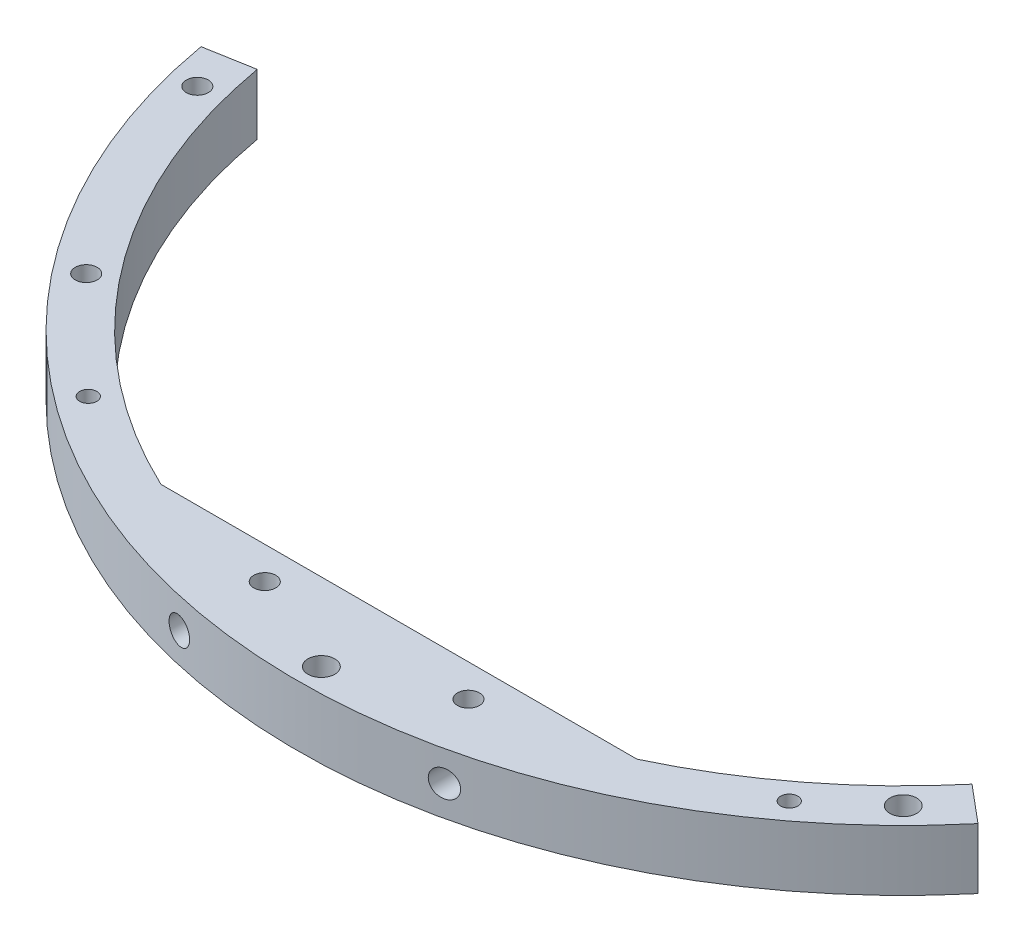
ISO-10303-21;
HEADER;
FILE_DESCRIPTION(('STEP AP214'),'2;1');
FILE_NAME('part.step','',(''),(''),'','','');
FILE_SCHEMA(('AUTOMOTIVE_DESIGN { 1 0 10303 214 1 1 1 1 }'));
ENDSEC;
DATA;
#1=APPLICATION_CONTEXT('core data for automotive mechanical design processes');
#2=APPLICATION_PROTOCOL_DEFINITION('international standard','automotive_design',2000,#1);
#3=PRODUCT_CONTEXT('',#1,'mechanical');
#4=PRODUCT('Part','Part','',(#3));
#5=PRODUCT_RELATED_PRODUCT_CATEGORY('part','',(#4));
#6=PRODUCT_DEFINITION_FORMATION('','',#4);
#7=PRODUCT_DEFINITION_CONTEXT('part definition',#1,'design');
#8=PRODUCT_DEFINITION('design','',#6,#7);
#9=PRODUCT_DEFINITION_SHAPE('','',#8);
#10=(LENGTH_UNIT() NAMED_UNIT(*) SI_UNIT(.MILLI.,.METRE.));
#11=(NAMED_UNIT(*) PLANE_ANGLE_UNIT() SI_UNIT($,.RADIAN.));
#12=(NAMED_UNIT(*) SI_UNIT($,.STERADIAN.) SOLID_ANGLE_UNIT());
#13=UNCERTAINTY_MEASURE_WITH_UNIT(LENGTH_MEASURE(1.E-05),#10,'distance_accuracy_value','');
#14=(GEOMETRIC_REPRESENTATION_CONTEXT(3) GLOBAL_UNCERTAINTY_ASSIGNED_CONTEXT((#13)) GLOBAL_UNIT_ASSIGNED_CONTEXT((#10,
#11,#12)) REPRESENTATION_CONTEXT('',''));
#15=CARTESIAN_POINT('',(0.,0.,0.));
#16=DIRECTION('',(0.,0.,1.));
#17=DIRECTION('',(1.,0.,0.));
#18=AXIS2_PLACEMENT_3D('',#15,#16,#17);
#19=CARTESIAN_POINT('',(0.,9.525,0.));
#20=DIRECTION('',(0.,-1.,0.));
#21=DIRECTION('',(0.,0.,-1.));
#22=AXIS2_PLACEMENT_3D('',#19,#20,#21);
#23=PLANE('',#22);
#24=CARTESIAN_POINT('',(-88.6970817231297,9.525,22.2283893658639));
#25=DIRECTION('',(0.,1.,0.));
#26=DIRECTION('',(0.,0.,1.));
#27=AXIS2_PLACEMENT_3D('',#24,#25,#26);
#28=CIRCLE('',#27,1.7272);
#29=CARTESIAN_POINT('',(-88.6970817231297,9.525,20.5011893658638));
#30=VERTEX_POINT('',#29);
#31=EDGE_CURVE('E179',#30,#30,#28,.T.);
#32=ORIENTED_EDGE('',*,*,#31,.F.);
#33=EDGE_LOOP('',(#32));
#34=FACE_BOUND('',#33,.T.);
#35=CARTESIAN_POINT('',(16.002,9.525,84.328000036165));
#36=DIRECTION('',(0.,1.,0.));
#37=DIRECTION('',(0.,0.,-1.));
#38=AXIS2_PLACEMENT_3D('',#35,#36,#37);
#39=CIRCLE('',#38,1.7272);
#40=CARTESIAN_POINT('',(16.002,9.525,82.600800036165));
#41=VERTEX_POINT('',#40);
#42=EDGE_CURVE('E167',#41,#41,#39,.T.);
#43=ORIENTED_EDGE('',*,*,#42,.F.);
#44=EDGE_LOOP('',(#43));
#45=FACE_BOUND('',#44,.T.);
#46=CARTESIAN_POINT('',(-55.073032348,9.525,72.9897937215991));
#47=DIRECTION('',(0.,1.,0.));
#48=DIRECTION('',(0.,0.,1.));
#49=AXIS2_PLACEMENT_3D('',#46,#47,#48);
#50=CIRCLE('',#49,1.35254999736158);
#51=CARTESIAN_POINT('',(-55.073032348,9.525,71.6372437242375));
#52=VERTEX_POINT('',#51);
#53=EDGE_CURVE('E155',#52,#52,#50,.T.);
#54=ORIENTED_EDGE('',*,*,#53,.F.);
#55=EDGE_LOOP('',(#54));
#56=FACE_BOUND('',#55,.T.);
#57=CARTESIAN_POINT('',(-16.002,9.525,84.328000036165));
#58=DIRECTION('',(0.,1.,0.));
#59=DIRECTION('',(0.,0.,1.));
#60=AXIS2_PLACEMENT_3D('',#57,#58,#59);
#61=CIRCLE('',#60,1.7272);
#62=CARTESIAN_POINT('',(-16.002,9.525,82.600800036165));
#63=VERTEX_POINT('',#62);
#64=EDGE_CURVE('E119',#63,#63,#61,.T.);
#65=ORIENTED_EDGE('',*,*,#64,.F.);
#66=EDGE_LOOP('',(#65));
#67=FACE_BOUND('',#66,.T.);
#68=CARTESIAN_POINT('',(0.,9.525,0.));
#69=DIRECTION('',(0.,1.,0.));
#70=DIRECTION('',(0.,0.,-1.));
#71=AXIS2_PLACEMENT_3D('',#68,#69,#70);
#72=CIRCLE('',#71,95.25);
#73=CARTESIAN_POINT('',(-93.8029384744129,9.525,16.5399889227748));
#74=VERTEX_POINT('',#73);
#75=CARTESIAN_POINT('',(72.9657332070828,9.525,61.2255198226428));
#76=VERTEX_POINT('',#75);
#77=EDGE_CURVE('E84',#74,#76,#72,.T.);
#78=ORIENTED_EDGE('',*,*,#77,.T.);
#79=DIRECTION('',(-0.766044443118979,0.,-0.642787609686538));
#80=VECTOR('',#79,1.);
#81=CARTESIAN_POINT('',(67.1284745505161,9.525,56.3274782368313));
#82=LINE('',#81,#80);
#83=CARTESIAN_POINT('',(67.1284745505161,9.525,56.3274782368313));
#84=VERTEX_POINT('',#83);
#85=EDGE_CURVE('E142',#76,#84,#82,.T.);
#86=ORIENTED_EDGE('',*,*,#85,.T.);
#87=CARTESIAN_POINT('',(0.,9.525,0.));
#88=DIRECTION('',(0.,-1.,0.));
#89=DIRECTION('',(0.,0.,-1.));
#90=AXIS2_PLACEMENT_3D('',#87,#88,#89);
#91=CIRCLE('',#90,87.63);
#92=CARTESIAN_POINT('',(37.400152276,9.525,79.248000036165));
#93=VERTEX_POINT('',#92);
#94=EDGE_CURVE('E98',#84,#93,#91,.T.);
#95=ORIENTED_EDGE('',*,*,#94,.T.);
#96=DIRECTION('',(-1.,0.,0.));
#97=VECTOR('',#96,1.);
#98=CARTESIAN_POINT('',(37.400152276,9.525,79.248000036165));
#99=LINE('',#98,#97);
#100=CARTESIAN_POINT('',(-37.400152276,9.525,79.248000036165));
#101=VERTEX_POINT('',#100);
#102=EDGE_CURVE('E92',#93,#101,#99,.T.);
#103=ORIENTED_EDGE('',*,*,#102,.T.);
#104=CARTESIAN_POINT('',(0.,9.525,0.));
#105=DIRECTION('',(0.,-1.,0.));
#106=DIRECTION('',(0.,0.,1.));
#107=AXIS2_PLACEMENT_3D('',#104,#105,#106);
#108=CIRCLE('',#107,87.63);
#109=CARTESIAN_POINT('',(-86.2987033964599,9.525,15.2167898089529));
#110=VERTEX_POINT('',#109);
#111=EDGE_CURVE('E96',#101,#110,#108,.T.);
#112=ORIENTED_EDGE('',*,*,#111,.T.);
#113=DIRECTION('',(-0.984807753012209,0.,0.173648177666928));
#114=VECTOR('',#113,1.);
#115=CARTESIAN_POINT('',(-86.2987033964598,9.525,15.2167898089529));
#116=LINE('',#115,#114);
#117=EDGE_CURVE('E49',#110,#74,#116,.T.);
#118=ORIENTED_EDGE('',*,*,#117,.T.);
#119=EDGE_LOOP('',(#78,#86,#95,#103,#112,#118));
#120=FACE_BOUND('',#119,.T.);
#121=CARTESIAN_POINT('',(55.073032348,9.525,72.9897937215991));
#122=DIRECTION('',(0.,1.,0.));
#123=DIRECTION('',(0.,0.,-1.));
#124=AXIS2_PLACEMENT_3D('',#121,#122,#123);
#125=CIRCLE('',#124,1.3525499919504);
#126=CARTESIAN_POINT('',(55.073032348,9.525,71.6372437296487));
#127=VERTEX_POINT('',#126);
#128=EDGE_CURVE('E149',#127,#127,#125,.T.);
#129=ORIENTED_EDGE('',*,*,#128,.F.);
#130=EDGE_LOOP('',(#129));
#131=FACE_BOUND('',#130,.T.);
#132=CARTESIAN_POINT('',(64.657844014,9.525,64.657844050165));
#133=DIRECTION('',(0.,1.,0.));
#134=DIRECTION('',(0.,0.,-1.));
#135=AXIS2_PLACEMENT_3D('',#132,#133,#134);
#136=CIRCLE('',#135,2.10819999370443);
#137=CARTESIAN_POINT('',(64.657844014,9.525,62.5496440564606));
#138=VERTEX_POINT('',#137);
#139=EDGE_CURVE('E161',#138,#138,#136,.T.);
#140=ORIENTED_EDGE('',*,*,#139,.F.);
#141=EDGE_LOOP('',(#140));
#142=FACE_BOUND('',#141,.T.);
#143=CARTESIAN_POINT('',(0.,9.525,91.440000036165));
#144=DIRECTION('',(0.,1.,0.));
#145=DIRECTION('',(0.,0.,1.));
#146=AXIS2_PLACEMENT_3D('',#143,#144,#145);
#147=CIRCLE('',#146,2.1082);
#148=CARTESIAN_POINT('',(0.,9.525,89.331800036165));
#149=VERTEX_POINT('',#148);
#150=EDGE_CURVE('E173',#149,#149,#147,.T.);
#151=ORIENTED_EDGE('',*,*,#150,.F.);
#152=EDGE_LOOP('',(#151));
#153=FACE_BOUND('',#152,.T.);
#154=CARTESIAN_POINT('',(-71.9390775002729,9.525,56.4450416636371));
#155=DIRECTION('',(0.,1.,0.));
#156=DIRECTION('',(0.,0.,1.));
#157=AXIS2_PLACEMENT_3D('',#154,#155,#156);
#158=CIRCLE('',#157,1.7272);
#159=CARTESIAN_POINT('',(-71.9390775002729,9.525,54.7178416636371));
#160=VERTEX_POINT('',#159);
#161=EDGE_CURVE('E185',#160,#160,#158,.T.);
#162=ORIENTED_EDGE('',*,*,#161,.F.);
#163=EDGE_LOOP('',(#162));
#164=FACE_BOUND('',#163,.T.);
#165=ADVANCED_FACE('F31',(#34,#45,#56,#67,#120,#131,#142,#153,#164),#23,.F.);
#166=CARTESIAN_POINT('',(0.,0.,0.));
#167=DIRECTION('',(0.,-1.,0.));
#168=DIRECTION('',(0.,0.,-1.));
#169=AXIS2_PLACEMENT_3D('',#166,#167,#168);
#170=PLANE('',#169);
#171=CARTESIAN_POINT('',(-88.6970817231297,0.,22.2283893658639));
#172=DIRECTION('',(0.,1.,0.));
#173=DIRECTION('',(0.,0.,1.));
#174=AXIS2_PLACEMENT_3D('',#171,#172,#173);
#175=CIRCLE('',#174,1.7272);
#176=CARTESIAN_POINT('',(-88.6970817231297,0.,20.5011893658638));
#177=VERTEX_POINT('',#176);
#178=EDGE_CURVE('E182',#177,#177,#175,.T.);
#179=ORIENTED_EDGE('',*,*,#178,.T.);
#180=EDGE_LOOP('',(#179));
#181=FACE_BOUND('',#180,.T.);
#182=CARTESIAN_POINT('',(16.002,0.,84.328000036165));
#183=DIRECTION('',(0.,1.,0.));
#184=DIRECTION('',(0.,0.,-1.));
#185=AXIS2_PLACEMENT_3D('',#182,#183,#184);
#186=CIRCLE('',#185,1.7272);
#187=CARTESIAN_POINT('',(16.002,0.,82.600800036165));
#188=VERTEX_POINT('',#187);
#189=EDGE_CURVE('E170',#188,#188,#186,.T.);
#190=ORIENTED_EDGE('',*,*,#189,.T.);
#191=EDGE_LOOP('',(#190));
#192=FACE_BOUND('',#191,.T.);
#193=CARTESIAN_POINT('',(-55.073032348,0.,72.9897937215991));
#194=DIRECTION('',(0.,1.,0.));
#195=DIRECTION('',(0.,0.,1.));
#196=AXIS2_PLACEMENT_3D('',#193,#194,#195);
#197=CIRCLE('',#196,1.35254999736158);
#198=CARTESIAN_POINT('',(-55.073032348,0.,71.6372437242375));
#199=VERTEX_POINT('',#198);
#200=EDGE_CURVE('E158',#199,#199,#197,.T.);
#201=ORIENTED_EDGE('',*,*,#200,.T.);
#202=EDGE_LOOP('',(#201));
#203=FACE_BOUND('',#202,.T.);
#204=CARTESIAN_POINT('',(-16.002,0.,84.328000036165));
#205=DIRECTION('',(0.,1.,0.));
#206=DIRECTION('',(0.,0.,1.));
#207=AXIS2_PLACEMENT_3D('',#204,#205,#206);
#208=CIRCLE('',#207,1.7272);
#209=CARTESIAN_POINT('',(-16.002,0.,82.600800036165));
#210=VERTEX_POINT('',#209);
#211=EDGE_CURVE('E146',#210,#210,#208,.T.);
#212=ORIENTED_EDGE('',*,*,#211,.T.);
#213=EDGE_LOOP('',(#212));
#214=FACE_BOUND('',#213,.T.);
#215=CARTESIAN_POINT('',(0.,0.,0.));
#216=DIRECTION('',(0.,1.,0.));
#217=DIRECTION('',(0.,0.,1.));
#218=AXIS2_PLACEMENT_3D('',#215,#216,#217);
#219=CIRCLE('',#218,95.25);
#220=CARTESIAN_POINT('',(-93.8029384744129,0.,16.5399889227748));
#221=VERTEX_POINT('',#220);
#222=CARTESIAN_POINT('',(72.9657332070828,0.,61.2255198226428));
#223=VERTEX_POINT('',#222);
#224=EDGE_CURVE('E78',#221,#223,#219,.T.);
#225=ORIENTED_EDGE('',*,*,#224,.F.);
#226=DIRECTION('',(-0.984807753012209,0.,0.173648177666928));
#227=VECTOR('',#226,1.);
#228=CARTESIAN_POINT('',(-86.2987033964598,0.,15.2167898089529));
#229=LINE('',#228,#227);
#230=CARTESIAN_POINT('',(-86.2987033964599,0.,15.2167898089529));
#231=VERTEX_POINT('',#230);
#232=EDGE_CURVE('E125',#231,#221,#229,.T.);
#233=ORIENTED_EDGE('',*,*,#232,.F.);
#234=CARTESIAN_POINT('',(0.,0.,0.));
#235=DIRECTION('',(0.,-1.,0.));
#236=DIRECTION('',(0.,0.,-1.));
#237=AXIS2_PLACEMENT_3D('',#234,#235,#236);
#238=CIRCLE('',#237,87.63);
#239=CARTESIAN_POINT('',(-37.400152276,0.,79.248000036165));
#240=VERTEX_POINT('',#239);
#241=EDGE_CURVE('E71',#240,#231,#238,.T.);
#242=ORIENTED_EDGE('',*,*,#241,.F.);
#243=DIRECTION('',(-1.,0.,0.));
#244=VECTOR('',#243,1.);
#245=CARTESIAN_POINT('',(37.400152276,0.,79.248000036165));
#246=LINE('',#245,#244);
#247=CARTESIAN_POINT('',(37.400152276,0.,79.248000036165));
#248=VERTEX_POINT('',#247);
#249=EDGE_CURVE('E107',#248,#240,#246,.T.);
#250=ORIENTED_EDGE('',*,*,#249,.F.);
#251=CARTESIAN_POINT('',(0.,0.,0.));
#252=DIRECTION('',(0.,-1.,0.));
#253=DIRECTION('',(0.,0.,-1.));
#254=AXIS2_PLACEMENT_3D('',#251,#252,#253);
#255=CIRCLE('',#254,87.63);
#256=CARTESIAN_POINT('',(67.1284745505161,0.,56.3274782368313));
#257=VERTEX_POINT('',#256);
#258=EDGE_CURVE('E121',#257,#248,#255,.T.);
#259=ORIENTED_EDGE('',*,*,#258,.F.);
#260=DIRECTION('',(-0.766044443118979,0.,-0.642787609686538));
#261=VECTOR('',#260,1.);
#262=CARTESIAN_POINT('',(67.1284745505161,0.,56.3274782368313));
#263=LINE('',#262,#261);
#264=EDGE_CURVE('E118',#223,#257,#263,.T.);
#265=ORIENTED_EDGE('',*,*,#264,.F.);
#266=EDGE_LOOP('',(#225,#233,#242,#250,#259,#265));
#267=FACE_BOUND('',#266,.T.);
#268=CARTESIAN_POINT('',(55.073032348,0.,72.9897937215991));
#269=DIRECTION('',(0.,1.,0.));
#270=DIRECTION('',(0.,0.,-1.));
#271=AXIS2_PLACEMENT_3D('',#268,#269,#270);
#272=CIRCLE('',#271,1.3525499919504);
#273=CARTESIAN_POINT('',(55.073032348,0.,71.6372437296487));
#274=VERTEX_POINT('',#273);
#275=EDGE_CURVE('E152',#274,#274,#272,.T.);
#276=ORIENTED_EDGE('',*,*,#275,.T.);
#277=EDGE_LOOP('',(#276));
#278=FACE_BOUND('',#277,.T.);
#279=CARTESIAN_POINT('',(64.657844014,0.,64.657844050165));
#280=DIRECTION('',(0.,1.,0.));
#281=DIRECTION('',(0.,0.,-1.));
#282=AXIS2_PLACEMENT_3D('',#279,#280,#281);
#283=CIRCLE('',#282,2.10819999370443);
#284=CARTESIAN_POINT('',(64.657844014,0.,62.5496440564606));
#285=VERTEX_POINT('',#284);
#286=EDGE_CURVE('E164',#285,#285,#283,.T.);
#287=ORIENTED_EDGE('',*,*,#286,.T.);
#288=EDGE_LOOP('',(#287));
#289=FACE_BOUND('',#288,.T.);
#290=CARTESIAN_POINT('',(0.,0.,91.440000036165));
#291=DIRECTION('',(0.,1.,0.));
#292=DIRECTION('',(0.,0.,1.));
#293=AXIS2_PLACEMENT_3D('',#290,#291,#292);
#294=CIRCLE('',#293,2.1082);
#295=CARTESIAN_POINT('',(0.,0.,89.331800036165));
#296=VERTEX_POINT('',#295);
#297=EDGE_CURVE('E176',#296,#296,#294,.T.);
#298=ORIENTED_EDGE('',*,*,#297,.T.);
#299=EDGE_LOOP('',(#298));
#300=FACE_BOUND('',#299,.T.);
#301=CARTESIAN_POINT('',(-71.9390775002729,0.,56.4450416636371));
#302=DIRECTION('',(0.,1.,0.));
#303=DIRECTION('',(0.,0.,1.));
#304=AXIS2_PLACEMENT_3D('',#301,#302,#303);
#305=CIRCLE('',#304,1.7272);
#306=CARTESIAN_POINT('',(-71.9390775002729,0.,54.7178416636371));
#307=VERTEX_POINT('',#306);
#308=EDGE_CURVE('E188',#307,#307,#305,.T.);
#309=ORIENTED_EDGE('',*,*,#308,.T.);
#310=EDGE_LOOP('',(#309));
#311=FACE_BOUND('',#310,.T.);
#312=ADVANCED_FACE('F137',(#181,#192,#203,#214,#267,#278,#289,#300,#311),#170,.T.);
#313=CARTESIAN_POINT('',(0.,9.525,0.));
#314=DIRECTION('',(0.,-1.,0.));
#315=DIRECTION('',(0.,0.,-1.));
#316=AXIS2_PLACEMENT_3D('',#313,#314,#315);
#317=CYLINDRICAL_SURFACE('',#316,95.25);
#318=CARTESIAN_POINT('',(18.7452,4.7625,93.3872581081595));
#319=CARTESIAN_POINT('',(18.7452053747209,4.87774308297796,93.387257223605));
#320=CARTESIAN_POINT('',(18.7548000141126,4.99307086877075,93.3853327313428));
#321=CARTESIAN_POINT('',(18.7929079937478,5.22052213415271,93.3776711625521));
#322=CARTESIAN_POINT('',(18.8214442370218,5.33264156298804,93.3719294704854));
#323=CARTESIAN_POINT('',(18.8965143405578,5.55031761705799,93.3567657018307));
#324=CARTESIAN_POINT('',(18.9430327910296,5.65587977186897,93.3473467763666));
#325=CARTESIAN_POINT('',(19.0526112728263,5.85759144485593,93.3250428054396));
#326=CARTESIAN_POINT('',(19.1156676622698,5.95374302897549,93.3121585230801));
#327=CARTESIAN_POINT('',(19.2569898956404,6.13482608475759,93.2830963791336));
#328=CARTESIAN_POINT('',(19.3353739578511,6.21966112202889,93.2668928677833));
#329=CARTESIAN_POINT('',(19.5046988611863,6.37499316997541,93.2316292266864));
#330=CARTESIAN_POINT('',(19.5956411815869,6.44548848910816,93.2125687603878));
#331=CARTESIAN_POINT('',(19.7892814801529,6.57156472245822,93.1716523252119));
#332=CARTESIAN_POINT('',(19.8921677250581,6.6268415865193,93.1497506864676));
#333=CARTESIAN_POINT('',(20.1053391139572,6.71936552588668,93.1039726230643));
#334=CARTESIAN_POINT('',(20.2156250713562,6.75661061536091,93.0800959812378));
#335=CARTESIAN_POINT('',(20.44290506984,6.81280318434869,93.0304462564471));
#336=CARTESIAN_POINT('',(20.5599909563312,6.83135366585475,93.0046440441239));
#337=CARTESIAN_POINT('',(20.7954479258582,6.84838897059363,92.9522802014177));
#338=CARTESIAN_POINT('',(20.9138191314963,6.8468718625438,92.9257184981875));
#339=CARTESIAN_POINT('',(21.1503305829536,6.82368481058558,92.8721752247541));
#340=CARTESIAN_POINT('',(21.2684418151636,6.80171873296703,92.8451932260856));
#341=CARTESIAN_POINT('',(21.4993117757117,6.73778339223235,92.7920046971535));
#342=CARTESIAN_POINT('',(21.6120703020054,6.69581337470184,92.765798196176));
#343=CARTESIAN_POINT('',(21.829059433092,6.59289957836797,92.714977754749));
#344=CARTESIAN_POINT('',(21.933284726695,6.5319440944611,92.6903648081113));
#345=CARTESIAN_POINT('',(22.1300111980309,6.39263671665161,92.6435930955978));
#346=CARTESIAN_POINT('',(22.2225132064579,6.31428605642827,92.6214341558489));
#347=CARTESIAN_POINT('',(22.3914790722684,6.1437173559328,92.5807302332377));
#348=CARTESIAN_POINT('',(22.4681825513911,6.05174968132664,92.5621316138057));
#349=CARTESIAN_POINT('',(22.6049583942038,5.85555406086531,92.5288243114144));
#350=CARTESIAN_POINT('',(22.6650334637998,5.751328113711,92.5141149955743));
#351=CARTESIAN_POINT('',(22.7651179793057,5.53662817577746,92.4895372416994));
#352=CARTESIAN_POINT('',(22.8056308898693,5.42640275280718,92.4795475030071));
#353=CARTESIAN_POINT('',(22.8676099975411,5.20041348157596,92.4642414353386));
#354=CARTESIAN_POINT('',(22.8890792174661,5.08465051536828,92.4589243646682));
#355=CARTESIAN_POINT('',(22.911948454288,4.85384273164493,92.4532598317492));
#356=CARTESIAN_POINT('',(22.9138156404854,4.73884681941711,92.452796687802));
#357=CARTESIAN_POINT('',(22.8986335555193,4.51019405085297,92.4565581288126));
#358=CARTESIAN_POINT('',(22.8815854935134,4.39653710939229,92.4607824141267));
#359=CARTESIAN_POINT('',(22.8293354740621,4.17460758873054,92.4736970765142));
#360=CARTESIAN_POINT('',(22.7942634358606,4.06630247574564,92.4823554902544));
#361=CARTESIAN_POINT('',(22.7071705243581,3.85717917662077,92.5037777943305));
#362=CARTESIAN_POINT('',(22.6551488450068,3.75636134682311,92.5165418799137));
#363=CARTESIAN_POINT('',(22.5349687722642,3.56359029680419,92.545888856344));
#364=CARTESIAN_POINT('',(22.4666062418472,3.47177180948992,92.5625199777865));
#365=CARTESIAN_POINT('',(22.3161742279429,3.3008715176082,92.5989030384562));
#366=CARTESIAN_POINT('',(22.2341030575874,3.22179128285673,92.6186553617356));
#367=CARTESIAN_POINT('',(22.0562931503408,3.07641641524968,92.6611622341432));
#368=CARTESIAN_POINT('',(21.9602548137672,3.01050716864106,92.6839814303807));
#369=CARTESIAN_POINT('',(21.7589076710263,2.89571072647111,92.7314570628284));
#370=CARTESIAN_POINT('',(21.6535975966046,2.84682586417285,92.7561137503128));
#371=CARTESIAN_POINT('',(21.4337978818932,2.76622592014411,92.8071540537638));
#372=CARTESIAN_POINT('',(21.319142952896,2.73497884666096,92.83356563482));
#373=CARTESIAN_POINT('',(21.0862684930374,2.69238697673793,92.8867377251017));
#374=CARTESIAN_POINT('',(20.968048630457,2.68104403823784,92.9134982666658));
#375=CARTESIAN_POINT('',(20.7297436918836,2.67856533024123,92.9669582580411));
#376=CARTESIAN_POINT('',(20.6096544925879,2.68769660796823,92.9936523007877));
#377=CARTESIAN_POINT('',(20.3725877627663,2.72655238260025,93.0458752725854));
#378=CARTESIAN_POINT('',(20.2556102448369,2.75627696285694,93.0714041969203));
#379=CARTESIAN_POINT('',(20.0286119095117,2.83547385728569,93.1205168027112));
#380=CARTESIAN_POINT('',(19.9185666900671,2.88487183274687,93.1441074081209));
#381=CARTESIAN_POINT('',(19.7082726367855,3.00217127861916,93.188830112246));
#382=CARTESIAN_POINT('',(19.6080226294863,3.07007052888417,93.2099625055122));
#383=CARTESIAN_POINT('',(19.4220388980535,3.22125127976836,93.2488916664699));
#384=CARTESIAN_POINT('',(19.3360875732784,3.30425198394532,93.2667389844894));
#385=CARTESIAN_POINT('',(19.1793547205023,3.4841222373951,93.2990957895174));
#386=CARTESIAN_POINT('',(19.1085752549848,3.580993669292,93.3136048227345));
#387=CARTESIAN_POINT('',(18.9858132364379,3.78364694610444,93.3386589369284));
#388=CARTESIAN_POINT('',(18.9334696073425,3.88920095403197,93.3492803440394));
#389=CARTESIAN_POINT('',(18.8472951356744,4.10780194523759,93.3667174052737));
#390=CARTESIAN_POINT('',(18.8134392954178,4.22083857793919,93.3735381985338));
#391=CARTESIAN_POINT('',(18.7746885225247,4.40597802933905,93.3813352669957));
#392=CARTESIAN_POINT('',(18.7636456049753,4.47680128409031,93.3835540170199));
#393=CARTESIAN_POINT('',(18.7488997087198,4.6192387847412,93.3865157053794));
#394=CARTESIAN_POINT('',(18.7451966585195,4.69085302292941,93.3872586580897));
#395=CARTESIAN_POINT('',(18.7452,4.7625,93.3872581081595));
#396=B_SPLINE_CURVE_WITH_KNOTS('',3,(#318,#319,#320,#321,#322,#323,#324,#325,#326,#327,#328,
#329,#330,#331,#332,#333,#334,#335,#336,#337,#338,#339,#340,#341,#342,#343,#344,#345,#346,#347,
#348,#349,#350,#351,#352,#353,#354,#355,#356,#357,#358,#359,#360,#361,#362,#363,#364,#365,#366,
#367,#368,#369,#370,#371,#372,#373,#374,#375,#376,#377,#378,#379,#380,#381,#382,#383,#384,#385,
#386,#387,#388,#389,#390,#391,#392,#393,#394,#395),.UNSPECIFIED.,.T.,.F.,(4,2,2,2,2,2,2,2,2,2,2,
2,2,2,2,2,2,2,2,2,2,2,2,2,2,2,2,2,2,2,2,2,2,2,2,2,2,2,4),(0.,0.345465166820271,0.69134881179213,
1.03693670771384,1.38244856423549,1.73073858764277,2.07906967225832,2.43392445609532,
2.78881831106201,3.15109921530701,3.5134149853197,3.88106066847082,4.24872021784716,
4.61660689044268,4.98446748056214,5.34625338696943,5.70798038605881,6.05982261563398,
6.41160898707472,6.75499175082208,7.09835256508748,7.43927239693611,7.7802084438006,
8.12564938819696,8.47113287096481,8.82558874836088,9.18009318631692,9.54360848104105,
9.90715770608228,10.2754762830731,10.6437963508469,11.0107376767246,11.3776349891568,
11.73830178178,12.0990175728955,12.4522140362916,12.8049317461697,13.019710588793,
13.2344873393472),.UNSPECIFIED.);
#397=CARTESIAN_POINT('',(18.7452,4.7625,93.3872581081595));
#398=VERTEX_POINT('',#397);
#399=EDGE_CURVE('E266',#398,#398,#396,.T.);
#400=ORIENTED_EDGE('',*,*,#399,.T.);
#401=EDGE_LOOP('',(#400));
#402=FACE_BOUND('',#401,.T.);
#403=CARTESIAN_POINT('',(-22.9108,4.7625,92.4535437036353));
#404=CARTESIAN_POINT('',(-22.9107945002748,4.87701433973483,92.4535452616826));
#405=CARTESIAN_POINT('',(-22.9013193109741,4.99161353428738,92.4558947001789));
#406=CARTESIAN_POINT('',(-22.8637032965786,5.21760618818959,92.4652038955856));
#407=CARTESIAN_POINT('',(-22.835539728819,5.32899556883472,92.4721692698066));
#408=CARTESIAN_POINT('',(-22.7615092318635,5.5452103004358,92.4904191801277));
#409=CARTESIAN_POINT('',(-22.7156624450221,5.65004296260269,92.5016988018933));
#410=CARTESIAN_POINT('',(-22.607736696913,5.85040809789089,92.5281352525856));
#411=CARTESIAN_POINT('',(-22.5456607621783,5.94594230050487,92.5432913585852));
#412=CARTESIAN_POINT('',(-22.4062104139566,6.12649933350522,92.5771539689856));
#413=CARTESIAN_POINT('',(-22.3286403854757,6.21136246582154,92.5959057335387));
#414=CARTESIAN_POINT('',(-22.161021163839,6.36692847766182,92.6361649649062));
#415=CARTESIAN_POINT('',(-22.0709699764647,6.43762908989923,92.6576728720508));
#416=CARTESIAN_POINT('',(-21.8782883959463,6.56489862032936,92.7033605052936));
#417=CARTESIAN_POINT('',(-21.7753814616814,6.62102847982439,92.7275971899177));
#418=CARTESIAN_POINT('',(-21.5619137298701,6.71520095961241,92.7774670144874));
#419=CARTESIAN_POINT('',(-21.4513519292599,6.75324120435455,92.8031003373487));
#420=CARTESIAN_POINT('',(-21.2230061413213,6.81096379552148,92.8555896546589));
#421=CARTESIAN_POINT('',(-21.1051153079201,6.83021096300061,92.8824601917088));
#422=CARTESIAN_POINT('',(-20.8677456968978,6.84832036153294,92.9360774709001));
#423=CARTESIAN_POINT('',(-20.7482668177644,6.84718128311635,92.9628242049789));
#424=CARTESIAN_POINT('',(-20.5101077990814,6.82439782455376,93.0156598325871));
#425=CARTESIAN_POINT('',(-20.3914417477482,6.80258908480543,93.0417417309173));
#426=CARTESIAN_POINT('',(-20.1593292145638,6.7387142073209,93.0923093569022));
#427=CARTESIAN_POINT('',(-20.0458826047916,6.69664856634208,93.116795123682));
#428=CARTESIAN_POINT('',(-19.8285263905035,6.5937409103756,93.163320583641));
#429=CARTESIAN_POINT('',(-19.7245438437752,6.53306172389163,93.1853793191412));
#430=CARTESIAN_POINT('',(-19.5282174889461,6.39438846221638,93.2267198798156));
#431=CARTESIAN_POINT('',(-19.4358725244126,6.31639610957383,93.2460019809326));
#432=CARTESIAN_POINT('',(-19.2673905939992,6.14689822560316,93.2809596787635));
#433=CARTESIAN_POINT('',(-19.1909758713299,6.05568168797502,93.296697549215));
#434=CARTESIAN_POINT('',(-19.0545868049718,5.8612089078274,93.3246488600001));
#435=CARTESIAN_POINT('',(-18.9946104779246,5.75795411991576,93.3368627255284));
#436=CARTESIAN_POINT('',(-18.8941208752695,5.54466124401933,93.3572561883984));
#437=CARTESIAN_POINT('',(-18.8532275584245,5.43480967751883,93.3655146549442));
#438=CARTESIAN_POINT('',(-18.7903989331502,5.2096018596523,93.3781797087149));
#439=CARTESIAN_POINT('',(-18.7684618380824,5.09424612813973,93.3825866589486));
#440=CARTESIAN_POINT('',(-18.744437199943,4.86312022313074,93.3874120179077));
#441=CARTESIAN_POINT('',(-18.742063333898,4.74738092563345,93.3878879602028));
#442=CARTESIAN_POINT('',(-18.7564876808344,4.51715545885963,93.3849919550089));
#443=CARTESIAN_POINT('',(-18.7732851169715,4.40266923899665,93.3816201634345));
#444=CARTESIAN_POINT('',(-18.8254082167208,4.17867500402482,93.3711261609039));
#445=CARTESIAN_POINT('',(-18.860657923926,4.06914856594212,93.3640193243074));
#446=CARTESIAN_POINT('',(-18.9485390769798,3.85762427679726,93.346223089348));
#447=CARTESIAN_POINT('',(-19.0011708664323,3.75562657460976,93.3355336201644));
#448=CARTESIAN_POINT('',(-19.1226580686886,3.56120865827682,93.3107191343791));
#449=CARTESIAN_POINT('',(-19.1916303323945,3.46886467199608,93.2965693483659));
#450=CARTESIAN_POINT('',(-19.3435113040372,3.29706547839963,93.2651975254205));
#451=CARTESIAN_POINT('',(-19.4264210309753,3.2176112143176,93.2479752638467));
#452=CARTESIAN_POINT('',(-19.6052545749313,3.07240061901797,93.2105410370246));
#453=CARTESIAN_POINT('',(-19.7013725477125,3.00689511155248,93.1902839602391));
#454=CARTESIAN_POINT('',(-19.9027547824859,2.89290945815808,93.1474822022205));
#455=CARTESIAN_POINT('',(-20.0080200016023,2.84443109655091,93.1249372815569));
#456=CARTESIAN_POINT('',(-20.2270475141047,2.76480843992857,93.0776119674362));
#457=CARTESIAN_POINT('',(-20.3409416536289,2.73404873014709,93.0527946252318));
#458=CARTESIAN_POINT('',(-20.572029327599,2.6921549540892,93.0019790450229));
#459=CARTESIAN_POINT('',(-20.6892232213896,2.68102303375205,92.9759806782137));
#460=CARTESIAN_POINT('',(-20.9257738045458,2.6785782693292,92.9230296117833));
#461=CARTESIAN_POINT('',(-21.0451322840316,2.68761741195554,92.8960681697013));
#462=CARTESIAN_POINT('',(-21.2806121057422,2.72597579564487,92.8424075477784));
#463=CARTESIAN_POINT('',(-21.3967332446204,2.75529630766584,92.8157083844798));
#464=CARTESIAN_POINT('',(-21.6231191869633,2.8336993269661,92.7632297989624));
#465=CARTESIAN_POINT('',(-21.7333463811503,2.88289475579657,92.7374565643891));
#466=CARTESIAN_POINT('',(-21.9439889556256,2.99979460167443,92.6878393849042));
#467=CARTESIAN_POINT('',(-22.0444050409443,3.0674976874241,92.6639953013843));
#468=CARTESIAN_POINT('',(-22.2312962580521,3.21876948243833,92.6193344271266));
#469=CARTESIAN_POINT('',(-22.3179172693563,3.30214852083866,92.5984862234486));
#470=CARTESIAN_POINT('',(-22.4758689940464,3.4830484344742,92.5602746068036));
#471=CARTESIAN_POINT('',(-22.547197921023,3.58057095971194,92.5429116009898));
#472=CARTESIAN_POINT('',(-22.670610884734,3.78439435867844,92.5127550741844));
#473=CARTESIAN_POINT('',(-22.7231267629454,3.8904189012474,92.4998592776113));
#474=CARTESIAN_POINT('',(-22.8095043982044,4.11012897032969,92.4785975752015));
#475=CARTESIAN_POINT('',(-22.8433930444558,4.22380318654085,92.47022514));
#476=CARTESIAN_POINT('',(-22.8818157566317,4.40902220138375,92.4607225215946));
#477=CARTESIAN_POINT('',(-22.8926690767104,4.47923945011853,92.4580351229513));
#478=CARTESIAN_POINT('',(-22.9071628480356,4.62046025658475,92.4544452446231));
#479=CARTESIAN_POINT('',(-22.9108034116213,4.69146380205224,92.4535427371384));
#480=CARTESIAN_POINT('',(-22.9108,4.7625,92.4535437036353));
#481=B_SPLINE_CURVE_WITH_KNOTS('',3,(#403,#404,#405,#406,#407,#408,#409,#410,#411,#412,#413,
#414,#415,#416,#417,#418,#419,#420,#421,#422,#423,#424,#425,#426,#427,#428,#429,#430,#431,#432,
#433,#434,#435,#436,#437,#438,#439,#440,#441,#442,#443,#444,#445,#446,#447,#448,#449,#450,#451,
#452,#453,#454,#455,#456,#457,#458,#459,#460,#461,#462,#463,#464,#465,#466,#467,#468,#469,#470,
#471,#472,#473,#474,#475,#476,#477,#478,#479,#480),.UNSPECIFIED.,.T.,.F.,(4,2,2,2,2,2,2,2,2,2,2,
2,2,2,2,2,2,2,2,2,2,2,2,2,2,2,2,2,2,2,2,2,2,2,2,2,2,2,4),(0.,0.34327933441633,0.686977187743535,
1.03028469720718,1.37352822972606,1.72141560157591,2.06935862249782,2.4268115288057,
2.78431136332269,3.14990602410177,3.51552416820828,3.88407421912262,4.25261523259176,
4.61802005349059,4.98338853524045,5.34172447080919,5.70001715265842,6.05083289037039,
6.40161555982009,6.74725496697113,7.09288036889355,7.43709410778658,7.78131465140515,
8.12807525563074,8.47486122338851,8.82743659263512,9.18004889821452,9.54005133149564,
9.90009312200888,10.2664667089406,10.6328632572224,11.0013714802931,11.369853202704,
11.7341341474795,12.0984576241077,12.4537820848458,12.8085922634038,13.0215406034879,
13.2344856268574),.UNSPECIFIED.);
#482=CARTESIAN_POINT('',(-22.9108,4.7625,92.4535437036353));
#483=VERTEX_POINT('',#482);
#484=EDGE_CURVE('E191',#483,#483,#481,.T.);
#485=ORIENTED_EDGE('',*,*,#484,.T.);
#486=EDGE_LOOP('',(#485));
#487=FACE_BOUND('',#486,.T.);
#488=ORIENTED_EDGE('',*,*,#224,.T.);
#489=DIRECTION('',(0.,-1.,0.));
#490=VECTOR('',#489,1.);
#491=CARTESIAN_POINT('',(72.9657332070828,9.525,61.2255198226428));
#492=LINE('',#491,#490);
#493=EDGE_CURVE('E11',#76,#223,#492,.T.);
#494=ORIENTED_EDGE('',*,*,#493,.F.);
#495=ORIENTED_EDGE('',*,*,#77,.F.);
#496=DIRECTION('',(0.,-1.,0.));
#497=VECTOR('',#496,1.);
#498=CARTESIAN_POINT('',(-93.8029384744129,9.525,16.5399889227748));
#499=LINE('',#498,#497);
#500=EDGE_CURVE('E113',#74,#221,#499,.T.);
#501=ORIENTED_EDGE('',*,*,#500,.T.);
#502=EDGE_LOOP('',(#488,#494,#495,#501));
#503=FACE_BOUND('',#502,.T.);
#504=ADVANCED_FACE('F33',(#402,#487,#503),#317,.T.);
#505=CARTESIAN_POINT('',(67.1284745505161,9.525,56.3274782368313));
#506=DIRECTION('',(-0.642787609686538,0.,0.766044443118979));
#507=DIRECTION('',(0.766044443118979,0.,0.642787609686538));
#508=AXIS2_PLACEMENT_3D('',#505,#506,#507);
#509=PLANE('',#508);
#510=ORIENTED_EDGE('',*,*,#264,.T.);
#511=DIRECTION('',(0.,-1.,0.));
#512=VECTOR('',#511,1.);
#513=CARTESIAN_POINT('',(67.1284745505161,9.525,56.3274782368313));
#514=LINE('',#513,#512);
#515=EDGE_CURVE('E41',#84,#257,#514,.T.);
#516=ORIENTED_EDGE('',*,*,#515,.F.);
#517=ORIENTED_EDGE('',*,*,#85,.F.);
#518=ORIENTED_EDGE('',*,*,#493,.T.);
#519=EDGE_LOOP('',(#510,#516,#517,#518));
#520=FACE_BOUND('',#519,.T.);
#521=ADVANCED_FACE('F255',(#520),#509,.F.);
#522=CARTESIAN_POINT('',(0.,9.525,0.));
#523=DIRECTION('',(0.,-1.,0.));
#524=DIRECTION('',(0.,0.,-1.));
#525=AXIS2_PLACEMENT_3D('',#522,#523,#524);
#526=CYLINDRICAL_SURFACE('',#525,87.63);
#527=ORIENTED_EDGE('',*,*,#258,.T.);
#528=DIRECTION('',(0.,-1.,0.));
#529=VECTOR('',#528,1.);
#530=CARTESIAN_POINT('',(37.400152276,9.525,79.248000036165));
#531=LINE('',#530,#529);
#532=EDGE_CURVE('E108',#93,#248,#531,.T.);
#533=ORIENTED_EDGE('',*,*,#532,.F.);
#534=ORIENTED_EDGE('',*,*,#94,.F.);
#535=ORIENTED_EDGE('',*,*,#515,.T.);
#536=EDGE_LOOP('',(#527,#533,#534,#535));
#537=FACE_BOUND('',#536,.T.);
#538=ADVANCED_FACE('F134',(#537),#526,.F.);
#539=CARTESIAN_POINT('',(37.400152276,9.525,79.248000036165));
#540=DIRECTION('',(0.,0.,1.));
#541=DIRECTION('',(1.,0.,0.));
#542=AXIS2_PLACEMENT_3D('',#539,#540,#541);
#543=PLANE('',#542);
#544=CARTESIAN_POINT('',(20.828,4.7625,79.248000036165));
#545=DIRECTION('',(0.,0.,-1.));
#546=DIRECTION('',(1.,0.,0.));
#547=AXIS2_PLACEMENT_3D('',#544,#545,#546);
#548=CIRCLE('',#547,2.0828);
#549=CARTESIAN_POINT('',(22.9108,4.7625,79.248000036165));
#550=VERTEX_POINT('',#549);
#551=EDGE_CURVE('E270',#550,#550,#548,.T.);
#552=ORIENTED_EDGE('',*,*,#551,.F.);
#553=EDGE_LOOP('',(#552));
#554=FACE_BOUND('',#553,.T.);
#555=CARTESIAN_POINT('',(-20.828,4.7625,79.248000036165));
#556=DIRECTION('',(0.,0.,-1.));
#557=DIRECTION('',(-1.,0.,0.));
#558=AXIS2_PLACEMENT_3D('',#555,#556,#557);
#559=CIRCLE('',#558,2.0828);
#560=CARTESIAN_POINT('',(-22.9108,4.7625,79.248000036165));
#561=VERTEX_POINT('',#560);
#562=EDGE_CURVE('E199',#561,#561,#559,.T.);
#563=ORIENTED_EDGE('',*,*,#562,.F.);
#564=EDGE_LOOP('',(#563));
#565=FACE_BOUND('',#564,.T.);
#566=ORIENTED_EDGE('',*,*,#249,.T.);
#567=DIRECTION('',(0.,-1.,0.));
#568=VECTOR('',#567,1.);
#569=CARTESIAN_POINT('',(-37.400152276,9.525,79.248000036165));
#570=LINE('',#569,#568);
#571=EDGE_CURVE('E104',#101,#240,#570,.T.);
#572=ORIENTED_EDGE('',*,*,#571,.F.);
#573=ORIENTED_EDGE('',*,*,#102,.F.);
#574=ORIENTED_EDGE('',*,*,#532,.T.);
#575=EDGE_LOOP('',(#566,#572,#573,#574));
#576=FACE_BOUND('',#575,.T.);
#577=ADVANCED_FACE('F105',(#554,#565,#576),#543,.F.);
#578=CARTESIAN_POINT('',(0.,9.525,0.));
#579=DIRECTION('',(0.,-1.,0.));
#580=DIRECTION('',(0.,0.,-1.));
#581=AXIS2_PLACEMENT_3D('',#578,#579,#580);
#582=CYLINDRICAL_SURFACE('',#581,87.63);
#583=ORIENTED_EDGE('',*,*,#241,.T.);
#584=DIRECTION('',(0.,-1.,0.));
#585=VECTOR('',#584,1.);
#586=CARTESIAN_POINT('',(-86.2987033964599,9.525,15.2167898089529));
#587=LINE('',#586,#585);
#588=EDGE_CURVE('E109',#110,#231,#587,.T.);
#589=ORIENTED_EDGE('',*,*,#588,.F.);
#590=ORIENTED_EDGE('',*,*,#111,.F.);
#591=ORIENTED_EDGE('',*,*,#571,.T.);
#592=EDGE_LOOP('',(#583,#589,#590,#591));
#593=FACE_BOUND('',#592,.T.);
#594=ADVANCED_FACE('F111',(#593),#582,.F.);
#595=CARTESIAN_POINT('',(-86.2987033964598,9.525,15.2167898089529));
#596=DIRECTION('',(0.173648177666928,0.,0.984807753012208));
#597=DIRECTION('',(0.984807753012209,0.,-0.173648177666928));
#598=AXIS2_PLACEMENT_3D('',#595,#596,#597);
#599=PLANE('',#598);
#600=ORIENTED_EDGE('',*,*,#232,.T.);
#601=ORIENTED_EDGE('',*,*,#500,.F.);
#602=ORIENTED_EDGE('',*,*,#117,.F.);
#603=ORIENTED_EDGE('',*,*,#588,.T.);
#604=EDGE_LOOP('',(#600,#601,#602,#603));
#605=FACE_BOUND('',#604,.T.);
#606=ADVANCED_FACE('F140',(#605),#599,.F.);
#607=CARTESIAN_POINT('',(-16.002,9.525,84.328000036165));
#608=DIRECTION('',(0.,-1.,0.));
#609=DIRECTION('',(0.,0.,-1.));
#610=AXIS2_PLACEMENT_3D('',#607,#608,#609);
#611=CYLINDRICAL_SURFACE('',#610,1.7272);
#612=CARTESIAN_POINT('',(-16.002,9.525,82.600800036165));
#613=CARTESIAN_POINT('',(-16.002,9.42578125,82.600800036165));
#614=CARTESIAN_POINT('',(-16.002,9.3265625,82.600800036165));
#615=CARTESIAN_POINT('',(-16.002,9.128125,82.600800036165));
#616=CARTESIAN_POINT('',(-16.002,9.02890625,82.600800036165));
#617=CARTESIAN_POINT('',(-16.002,8.83046875,82.600800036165));
#618=CARTESIAN_POINT('',(-16.002,8.73125,82.600800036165));
#619=CARTESIAN_POINT('',(-16.002,8.5328125,82.600800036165));
#620=CARTESIAN_POINT('',(-16.002,8.43359375,82.600800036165));
#621=CARTESIAN_POINT('',(-16.002,8.23515625,82.600800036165));
#622=CARTESIAN_POINT('',(-16.002,8.1359375,82.600800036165));
#623=CARTESIAN_POINT('',(-16.002,7.9375,82.600800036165));
#624=CARTESIAN_POINT('',(-16.002,7.83828125,82.600800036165));
#625=CARTESIAN_POINT('',(-16.002,7.63984375,82.600800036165));
#626=CARTESIAN_POINT('',(-16.002,7.540625,82.600800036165));
#627=CARTESIAN_POINT('',(-16.002,7.3421875,82.600800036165));
#628=CARTESIAN_POINT('',(-16.002,7.24296875,82.600800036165));
#629=CARTESIAN_POINT('',(-16.002,7.04453125,82.600800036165));
#630=CARTESIAN_POINT('',(-16.002,6.9453125,82.600800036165));
#631=CARTESIAN_POINT('',(-16.002,6.746875,82.600800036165));
#632=CARTESIAN_POINT('',(-16.002,6.64765625,82.600800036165));
#633=CARTESIAN_POINT('',(-16.002,6.44921875,82.600800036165));
#634=CARTESIAN_POINT('',(-16.002,6.35,82.600800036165));
#635=CARTESIAN_POINT('',(-16.002,6.1515625,82.600800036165));
#636=CARTESIAN_POINT('',(-16.002,6.05234375,82.600800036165));
#637=CARTESIAN_POINT('',(-16.002,5.85390625,82.600800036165));
#638=CARTESIAN_POINT('',(-16.002,5.7546875,82.600800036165));
#639=CARTESIAN_POINT('',(-16.002,5.55625,82.600800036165));
#640=CARTESIAN_POINT('',(-16.002,5.45703125,82.600800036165));
#641=CARTESIAN_POINT('',(-16.002,5.25859375,82.600800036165));
#642=CARTESIAN_POINT('',(-16.002,5.159375,82.600800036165));
#643=CARTESIAN_POINT('',(-16.002,4.9609375,82.600800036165));
#644=CARTESIAN_POINT('',(-16.002,4.86171875,82.600800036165));
#645=CARTESIAN_POINT('',(-16.002,4.66328125,82.600800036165));
#646=CARTESIAN_POINT('',(-16.002,4.5640625,82.600800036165));
#647=CARTESIAN_POINT('',(-16.002,4.365625,82.600800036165));
#648=CARTESIAN_POINT('',(-16.002,4.26640625,82.600800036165));
#649=CARTESIAN_POINT('',(-16.002,4.06796875,82.600800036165));
#650=CARTESIAN_POINT('',(-16.002,3.96875,82.600800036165));
#651=CARTESIAN_POINT('',(-16.002,3.7703125,82.600800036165));
#652=CARTESIAN_POINT('',(-16.002,3.67109375,82.600800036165));
#653=CARTESIAN_POINT('',(-16.002,3.47265625,82.600800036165));
#654=CARTESIAN_POINT('',(-16.002,3.3734375,82.600800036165));
#655=CARTESIAN_POINT('',(-16.002,3.175,82.600800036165));
#656=CARTESIAN_POINT('',(-16.002,3.07578125,82.600800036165));
#657=CARTESIAN_POINT('',(-16.002,2.87734375,82.600800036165));
#658=CARTESIAN_POINT('',(-16.002,2.778125,82.600800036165));
#659=CARTESIAN_POINT('',(-16.002,2.5796875,82.600800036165));
#660=CARTESIAN_POINT('',(-16.002,2.48046875,82.600800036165));
#661=CARTESIAN_POINT('',(-16.002,2.28203125,82.600800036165));
#662=CARTESIAN_POINT('',(-16.002,2.1828125,82.600800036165));
#663=CARTESIAN_POINT('',(-16.002,1.984375,82.600800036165));
#664=CARTESIAN_POINT('',(-16.002,1.88515625,82.600800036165));
#665=CARTESIAN_POINT('',(-16.002,1.68671875,82.600800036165));
#666=CARTESIAN_POINT('',(-16.002,1.5875,82.600800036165));
#667=CARTESIAN_POINT('',(-16.002,1.3890625,82.600800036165));
#668=CARTESIAN_POINT('',(-16.002,1.28984375,82.600800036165));
#669=CARTESIAN_POINT('',(-16.002,1.09140625,82.600800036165));
#670=CARTESIAN_POINT('',(-16.002,0.992187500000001,82.600800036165));
#671=CARTESIAN_POINT('',(-16.002,0.793750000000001,82.600800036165));
#672=CARTESIAN_POINT('',(-16.002,0.69453125,82.600800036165));
#673=CARTESIAN_POINT('',(-16.002,0.49609375,82.600800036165));
#674=CARTESIAN_POINT('',(-16.002,0.396875,82.600800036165));
#675=CARTESIAN_POINT('',(-16.002,0.1984375,82.600800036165));
#676=CARTESIAN_POINT('',(-16.002,0.0992187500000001,82.600800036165));
#677=CARTESIAN_POINT('',(-16.002,0.,82.600800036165));
#678=B_SPLINE_CURVE_WITH_KNOTS('',3,(#612,#613,#614,#615,#616,#617,#618,#619,#620,#621,#622,
#623,#624,#625,#626,#627,#628,#629,#630,#631,#632,#633,#634,#635,#636,#637,#638,#639,#640,#641,
#642,#643,#644,#645,#646,#647,#648,#649,#650,#651,#652,#653,#654,#655,#656,#657,#658,#659,#660,
#661,#662,#663,#664,#665,#666,#667,#668,#669,#670,#671,#672,#673,#674,#675,#676,#677),
.UNSPECIFIED.,.F.,.F.,(4,2,2,2,2,2,2,2,2,2,2,2,2,2,2,2,2,2,2,2,2,2,2,2,2,2,2,2,2,2,2,2,4),(0.,
0.29765625,0.5953125,0.892968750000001,1.190625,1.48828125,1.7859375,2.08359375,2.38125,
2.67890625,2.9765625,3.27421875,3.571875,3.86953125,4.1671875,4.46484375,4.7625,5.06015625,
5.3578125,5.65546875,5.953125,6.25078125,6.5484375,6.84609375,7.14375,7.44140625,7.7390625,
8.03671875,8.334375,8.63203125,8.9296875,9.22734375,9.525),.UNSPECIFIED.);
#679=EDGE_CURVE('BSEAM236',#63,#210,#678,.T.);
#680=ORIENTED_EDGE('',*,*,#64,.T.);
#681=ORIENTED_EDGE('',*,*,#211,.F.);
#682=ORIENTED_EDGE('',*,*,#679,.T.);
#683=ORIENTED_EDGE('',*,*,#679,.F.);
#684=EDGE_LOOP('',(#680,#682,#681,#683));
#685=FACE_BOUND('',#684,.T.);
#686=ADVANCED_FACE('F236',(#685),#611,.F.);
#687=CARTESIAN_POINT('',(55.073032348,9.525,72.9897937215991));
#688=DIRECTION('',(0.,-1.,0.));
#689=DIRECTION('',(0.,0.,-1.));
#690=AXIS2_PLACEMENT_3D('',#687,#688,#689);
#691=CYLINDRICAL_SURFACE('',#690,1.3525499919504);
#692=CARTESIAN_POINT('',(55.073032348,9.525,71.6372437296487));
#693=CARTESIAN_POINT('',(55.073032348,9.42578125,71.6372437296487));
#694=CARTESIAN_POINT('',(55.073032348,9.3265625,71.6372437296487));
#695=CARTESIAN_POINT('',(55.073032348,9.128125,71.6372437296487));
#696=CARTESIAN_POINT('',(55.073032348,9.02890625,71.6372437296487));
#697=CARTESIAN_POINT('',(55.073032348,8.83046875,71.6372437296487));
#698=CARTESIAN_POINT('',(55.073032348,8.73125,71.6372437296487));
#699=CARTESIAN_POINT('',(55.073032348,8.5328125,71.6372437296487));
#700=CARTESIAN_POINT('',(55.073032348,8.43359375,71.6372437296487));
#701=CARTESIAN_POINT('',(55.073032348,8.23515625,71.6372437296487));
#702=CARTESIAN_POINT('',(55.073032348,8.1359375,71.6372437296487));
#703=CARTESIAN_POINT('',(55.073032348,7.9375,71.6372437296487));
#704=CARTESIAN_POINT('',(55.073032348,7.83828125,71.6372437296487));
#705=CARTESIAN_POINT('',(55.073032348,7.63984375,71.6372437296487));
#706=CARTESIAN_POINT('',(55.073032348,7.540625,71.6372437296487));
#707=CARTESIAN_POINT('',(55.073032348,7.3421875,71.6372437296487));
#708=CARTESIAN_POINT('',(55.073032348,7.24296875,71.6372437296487));
#709=CARTESIAN_POINT('',(55.073032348,7.04453125,71.6372437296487));
#710=CARTESIAN_POINT('',(55.073032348,6.9453125,71.6372437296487));
#711=CARTESIAN_POINT('',(55.073032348,6.746875,71.6372437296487));
#712=CARTESIAN_POINT('',(55.073032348,6.64765625,71.6372437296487));
#713=CARTESIAN_POINT('',(55.073032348,6.44921875,71.6372437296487));
#714=CARTESIAN_POINT('',(55.073032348,6.35,71.6372437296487));
#715=CARTESIAN_POINT('',(55.073032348,6.1515625,71.6372437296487));
#716=CARTESIAN_POINT('',(55.073032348,6.05234375,71.6372437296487));
#717=CARTESIAN_POINT('',(55.073032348,5.85390625,71.6372437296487));
#718=CARTESIAN_POINT('',(55.073032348,5.7546875,71.6372437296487));
#719=CARTESIAN_POINT('',(55.073032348,5.55625,71.6372437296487));
#720=CARTESIAN_POINT('',(55.073032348,5.45703125,71.6372437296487));
#721=CARTESIAN_POINT('',(55.073032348,5.25859375,71.6372437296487));
#722=CARTESIAN_POINT('',(55.073032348,5.159375,71.6372437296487));
#723=CARTESIAN_POINT('',(55.073032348,4.9609375,71.6372437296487));
#724=CARTESIAN_POINT('',(55.073032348,4.86171875,71.6372437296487));
#725=CARTESIAN_POINT('',(55.073032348,4.66328125,71.6372437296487));
#726=CARTESIAN_POINT('',(55.073032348,4.5640625,71.6372437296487));
#727=CARTESIAN_POINT('',(55.073032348,4.365625,71.6372437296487));
#728=CARTESIAN_POINT('',(55.073032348,4.26640625,71.6372437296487));
#729=CARTESIAN_POINT('',(55.073032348,4.06796875,71.6372437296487));
#730=CARTESIAN_POINT('',(55.073032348,3.96875,71.6372437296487));
#731=CARTESIAN_POINT('',(55.073032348,3.7703125,71.6372437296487));
#732=CARTESIAN_POINT('',(55.073032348,3.67109375,71.6372437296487));
#733=CARTESIAN_POINT('',(55.073032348,3.47265625,71.6372437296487));
#734=CARTESIAN_POINT('',(55.073032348,3.3734375,71.6372437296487));
#735=CARTESIAN_POINT('',(55.073032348,3.175,71.6372437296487));
#736=CARTESIAN_POINT('',(55.073032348,3.07578125,71.6372437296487));
#737=CARTESIAN_POINT('',(55.073032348,2.87734375,71.6372437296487));
#738=CARTESIAN_POINT('',(55.073032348,2.778125,71.6372437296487));
#739=CARTESIAN_POINT('',(55.073032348,2.5796875,71.6372437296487));
#740=CARTESIAN_POINT('',(55.073032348,2.48046875,71.6372437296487));
#741=CARTESIAN_POINT('',(55.073032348,2.28203125,71.6372437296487));
#742=CARTESIAN_POINT('',(55.073032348,2.1828125,71.6372437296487));
#743=CARTESIAN_POINT('',(55.073032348,1.984375,71.6372437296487));
#744=CARTESIAN_POINT('',(55.073032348,1.88515625,71.6372437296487));
#745=CARTESIAN_POINT('',(55.073032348,1.68671875,71.6372437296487));
#746=CARTESIAN_POINT('',(55.073032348,1.5875,71.6372437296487));
#747=CARTESIAN_POINT('',(55.073032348,1.3890625,71.6372437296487));
#748=CARTESIAN_POINT('',(55.073032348,1.28984375,71.6372437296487));
#749=CARTESIAN_POINT('',(55.073032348,1.09140625,71.6372437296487));
#750=CARTESIAN_POINT('',(55.073032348,0.992187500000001,71.6372437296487));
#751=CARTESIAN_POINT('',(55.073032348,0.793750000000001,71.6372437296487));
#752=CARTESIAN_POINT('',(55.073032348,0.69453125,71.6372437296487));
#753=CARTESIAN_POINT('',(55.073032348,0.49609375,71.6372437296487));
#754=CARTESIAN_POINT('',(55.073032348,0.396875,71.6372437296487));
#755=CARTESIAN_POINT('',(55.073032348,0.1984375,71.6372437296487));
#756=CARTESIAN_POINT('',(55.073032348,0.0992187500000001,71.6372437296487));
#757=CARTESIAN_POINT('',(55.073032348,0.,71.6372437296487));
#758=B_SPLINE_CURVE_WITH_KNOTS('',3,(#692,#693,#694,#695,#696,#697,#698,#699,#700,#701,#702,
#703,#704,#705,#706,#707,#708,#709,#710,#711,#712,#713,#714,#715,#716,#717,#718,#719,#720,#721,
#722,#723,#724,#725,#726,#727,#728,#729,#730,#731,#732,#733,#734,#735,#736,#737,#738,#739,#740,
#741,#742,#743,#744,#745,#746,#747,#748,#749,#750,#751,#752,#753,#754,#755,#756,#757),
.UNSPECIFIED.,.F.,.F.,(4,2,2,2,2,2,2,2,2,2,2,2,2,2,2,2,2,2,2,2,2,2,2,2,2,2,2,2,2,2,2,2,4),(0.,
0.29765625,0.5953125,0.892968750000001,1.190625,1.48828125,1.7859375,2.08359375,2.38125,
2.67890625,2.9765625,3.27421875,3.571875,3.86953125,4.1671875,4.46484375,4.7625,5.06015625,
5.3578125,5.65546875,5.953125,6.25078125,6.5484375,6.84609375,7.14375,7.44140625,7.7390625,
8.03671875,8.334375,8.63203125,8.9296875,9.22734375,9.525),.UNSPECIFIED.);
#759=EDGE_CURVE('BSEAM232',#127,#274,#758,.T.);
#760=ORIENTED_EDGE('',*,*,#128,.T.);
#761=ORIENTED_EDGE('',*,*,#275,.F.);
#762=ORIENTED_EDGE('',*,*,#759,.T.);
#763=ORIENTED_EDGE('',*,*,#759,.F.);
#764=EDGE_LOOP('',(#760,#762,#761,#763));
#765=FACE_BOUND('',#764,.T.);
#766=ADVANCED_FACE('F232',(#765),#691,.F.);
#767=CARTESIAN_POINT('',(-55.073032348,9.525,72.9897937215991));
#768=DIRECTION('',(0.,-1.,0.));
#769=DIRECTION('',(0.,0.,-1.));
#770=AXIS2_PLACEMENT_3D('',#767,#768,#769);
#771=CYLINDRICAL_SURFACE('',#770,1.35254999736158);
#772=CARTESIAN_POINT('',(-55.073032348,9.525,71.6372437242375));
#773=CARTESIAN_POINT('',(-55.073032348,9.42578125,71.6372437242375));
#774=CARTESIAN_POINT('',(-55.073032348,9.3265625,71.6372437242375));
#775=CARTESIAN_POINT('',(-55.073032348,9.128125,71.6372437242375));
#776=CARTESIAN_POINT('',(-55.073032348,9.02890625,71.6372437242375));
#777=CARTESIAN_POINT('',(-55.073032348,8.83046875,71.6372437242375));
#778=CARTESIAN_POINT('',(-55.073032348,8.73125,71.6372437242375));
#779=CARTESIAN_POINT('',(-55.073032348,8.5328125,71.6372437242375));
#780=CARTESIAN_POINT('',(-55.073032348,8.43359375,71.6372437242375));
#781=CARTESIAN_POINT('',(-55.073032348,8.23515625,71.6372437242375));
#782=CARTESIAN_POINT('',(-55.073032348,8.1359375,71.6372437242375));
#783=CARTESIAN_POINT('',(-55.073032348,7.9375,71.6372437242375));
#784=CARTESIAN_POINT('',(-55.073032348,7.83828125,71.6372437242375));
#785=CARTESIAN_POINT('',(-55.073032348,7.63984375,71.6372437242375));
#786=CARTESIAN_POINT('',(-55.073032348,7.540625,71.6372437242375));
#787=CARTESIAN_POINT('',(-55.073032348,7.3421875,71.6372437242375));
#788=CARTESIAN_POINT('',(-55.073032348,7.24296875,71.6372437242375));
#789=CARTESIAN_POINT('',(-55.073032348,7.04453125,71.6372437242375));
#790=CARTESIAN_POINT('',(-55.073032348,6.9453125,71.6372437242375));
#791=CARTESIAN_POINT('',(-55.073032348,6.746875,71.6372437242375));
#792=CARTESIAN_POINT('',(-55.073032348,6.64765625,71.6372437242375));
#793=CARTESIAN_POINT('',(-55.073032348,6.44921875,71.6372437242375));
#794=CARTESIAN_POINT('',(-55.073032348,6.35,71.6372437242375));
#795=CARTESIAN_POINT('',(-55.073032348,6.1515625,71.6372437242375));
#796=CARTESIAN_POINT('',(-55.073032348,6.05234375,71.6372437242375));
#797=CARTESIAN_POINT('',(-55.073032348,5.85390625,71.6372437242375));
#798=CARTESIAN_POINT('',(-55.073032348,5.7546875,71.6372437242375));
#799=CARTESIAN_POINT('',(-55.073032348,5.55625,71.6372437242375));
#800=CARTESIAN_POINT('',(-55.073032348,5.45703125,71.6372437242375));
#801=CARTESIAN_POINT('',(-55.073032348,5.25859375,71.6372437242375));
#802=CARTESIAN_POINT('',(-55.073032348,5.159375,71.6372437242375));
#803=CARTESIAN_POINT('',(-55.073032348,4.9609375,71.6372437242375));
#804=CARTESIAN_POINT('',(-55.073032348,4.86171875,71.6372437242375));
#805=CARTESIAN_POINT('',(-55.073032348,4.66328125,71.6372437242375));
#806=CARTESIAN_POINT('',(-55.073032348,4.5640625,71.6372437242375));
#807=CARTESIAN_POINT('',(-55.073032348,4.365625,71.6372437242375));
#808=CARTESIAN_POINT('',(-55.073032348,4.26640625,71.6372437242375));
#809=CARTESIAN_POINT('',(-55.073032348,4.06796875,71.6372437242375));
#810=CARTESIAN_POINT('',(-55.073032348,3.96875,71.6372437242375));
#811=CARTESIAN_POINT('',(-55.073032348,3.7703125,71.6372437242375));
#812=CARTESIAN_POINT('',(-55.073032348,3.67109375,71.6372437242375));
#813=CARTESIAN_POINT('',(-55.073032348,3.47265625,71.6372437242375));
#814=CARTESIAN_POINT('',(-55.073032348,3.3734375,71.6372437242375));
#815=CARTESIAN_POINT('',(-55.073032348,3.175,71.6372437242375));
#816=CARTESIAN_POINT('',(-55.073032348,3.07578125,71.6372437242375));
#817=CARTESIAN_POINT('',(-55.073032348,2.87734375,71.6372437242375));
#818=CARTESIAN_POINT('',(-55.073032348,2.778125,71.6372437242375));
#819=CARTESIAN_POINT('',(-55.073032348,2.5796875,71.6372437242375));
#820=CARTESIAN_POINT('',(-55.073032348,2.48046875,71.6372437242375));
#821=CARTESIAN_POINT('',(-55.073032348,2.28203125,71.6372437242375));
#822=CARTESIAN_POINT('',(-55.073032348,2.1828125,71.6372437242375));
#823=CARTESIAN_POINT('',(-55.073032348,1.984375,71.6372437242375));
#824=CARTESIAN_POINT('',(-55.073032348,1.88515625,71.6372437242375));
#825=CARTESIAN_POINT('',(-55.073032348,1.68671875,71.6372437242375));
#826=CARTESIAN_POINT('',(-55.073032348,1.5875,71.6372437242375));
#827=CARTESIAN_POINT('',(-55.073032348,1.3890625,71.6372437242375));
#828=CARTESIAN_POINT('',(-55.073032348,1.28984375,71.6372437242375));
#829=CARTESIAN_POINT('',(-55.073032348,1.09140625,71.6372437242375));
#830=CARTESIAN_POINT('',(-55.073032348,0.992187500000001,71.6372437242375));
#831=CARTESIAN_POINT('',(-55.073032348,0.793750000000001,71.6372437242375));
#832=CARTESIAN_POINT('',(-55.073032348,0.69453125,71.6372437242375));
#833=CARTESIAN_POINT('',(-55.073032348,0.49609375,71.6372437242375));
#834=CARTESIAN_POINT('',(-55.073032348,0.396875,71.6372437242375));
#835=CARTESIAN_POINT('',(-55.073032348,0.1984375,71.6372437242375));
#836=CARTESIAN_POINT('',(-55.073032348,0.0992187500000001,71.6372437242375));
#837=CARTESIAN_POINT('',(-55.073032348,0.,71.6372437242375));
#838=B_SPLINE_CURVE_WITH_KNOTS('',3,(#772,#773,#774,#775,#776,#777,#778,#779,#780,#781,#782,
#783,#784,#785,#786,#787,#788,#789,#790,#791,#792,#793,#794,#795,#796,#797,#798,#799,#800,#801,
#802,#803,#804,#805,#806,#807,#808,#809,#810,#811,#812,#813,#814,#815,#816,#817,#818,#819,#820,
#821,#822,#823,#824,#825,#826,#827,#828,#829,#830,#831,#832,#833,#834,#835,#836,#837),
.UNSPECIFIED.,.F.,.F.,(4,2,2,2,2,2,2,2,2,2,2,2,2,2,2,2,2,2,2,2,2,2,2,2,2,2,2,2,2,2,2,2,4),(0.,
0.29765625,0.5953125,0.892968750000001,1.190625,1.48828125,1.7859375,2.08359375,2.38125,
2.67890625,2.9765625,3.27421875,3.571875,3.86953125,4.1671875,4.46484375,4.7625,5.06015625,
5.3578125,5.65546875,5.953125,6.25078125,6.5484375,6.84609375,7.14375,7.44140625,7.7390625,
8.03671875,8.334375,8.63203125,8.9296875,9.22734375,9.525),.UNSPECIFIED.);
#839=EDGE_CURVE('BSEAM228',#52,#199,#838,.T.);
#840=ORIENTED_EDGE('',*,*,#53,.T.);
#841=ORIENTED_EDGE('',*,*,#200,.F.);
#842=ORIENTED_EDGE('',*,*,#839,.T.);
#843=ORIENTED_EDGE('',*,*,#839,.F.);
#844=EDGE_LOOP('',(#840,#842,#841,#843));
#845=FACE_BOUND('',#844,.T.);
#846=ADVANCED_FACE('F228',(#845),#771,.F.);
#847=CARTESIAN_POINT('',(64.657844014,9.525,64.657844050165));
#848=DIRECTION('',(0.,-1.,0.));
#849=DIRECTION('',(0.,0.,-1.));
#850=AXIS2_PLACEMENT_3D('',#847,#848,#849);
#851=CYLINDRICAL_SURFACE('',#850,2.10819999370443);
#852=CARTESIAN_POINT('',(64.657844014,9.525,62.5496440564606));
#853=CARTESIAN_POINT('',(64.657844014,9.42578125,62.5496440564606));
#854=CARTESIAN_POINT('',(64.657844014,9.3265625,62.5496440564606));
#855=CARTESIAN_POINT('',(64.657844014,9.128125,62.5496440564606));
#856=CARTESIAN_POINT('',(64.657844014,9.02890625,62.5496440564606));
#857=CARTESIAN_POINT('',(64.657844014,8.83046875,62.5496440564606));
#858=CARTESIAN_POINT('',(64.657844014,8.73125,62.5496440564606));
#859=CARTESIAN_POINT('',(64.657844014,8.5328125,62.5496440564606));
#860=CARTESIAN_POINT('',(64.657844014,8.43359375,62.5496440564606));
#861=CARTESIAN_POINT('',(64.657844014,8.23515625,62.5496440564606));
#862=CARTESIAN_POINT('',(64.657844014,8.1359375,62.5496440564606));
#863=CARTESIAN_POINT('',(64.657844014,7.9375,62.5496440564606));
#864=CARTESIAN_POINT('',(64.657844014,7.83828125,62.5496440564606));
#865=CARTESIAN_POINT('',(64.657844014,7.63984375,62.5496440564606));
#866=CARTESIAN_POINT('',(64.657844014,7.540625,62.5496440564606));
#867=CARTESIAN_POINT('',(64.657844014,7.3421875,62.5496440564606));
#868=CARTESIAN_POINT('',(64.657844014,7.24296875,62.5496440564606));
#869=CARTESIAN_POINT('',(64.657844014,7.04453125,62.5496440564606));
#870=CARTESIAN_POINT('',(64.657844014,6.9453125,62.5496440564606));
#871=CARTESIAN_POINT('',(64.657844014,6.746875,62.5496440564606));
#872=CARTESIAN_POINT('',(64.657844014,6.64765625,62.5496440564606));
#873=CARTESIAN_POINT('',(64.657844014,6.44921875,62.5496440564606));
#874=CARTESIAN_POINT('',(64.657844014,6.35,62.5496440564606));
#875=CARTESIAN_POINT('',(64.657844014,6.1515625,62.5496440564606));
#876=CARTESIAN_POINT('',(64.657844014,6.05234375,62.5496440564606));
#877=CARTESIAN_POINT('',(64.657844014,5.85390625,62.5496440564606));
#878=CARTESIAN_POINT('',(64.657844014,5.7546875,62.5496440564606));
#879=CARTESIAN_POINT('',(64.657844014,5.55625,62.5496440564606));
#880=CARTESIAN_POINT('',(64.657844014,5.45703125,62.5496440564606));
#881=CARTESIAN_POINT('',(64.657844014,5.25859375,62.5496440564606));
#882=CARTESIAN_POINT('',(64.657844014,5.159375,62.5496440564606));
#883=CARTESIAN_POINT('',(64.657844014,4.9609375,62.5496440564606));
#884=CARTESIAN_POINT('',(64.657844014,4.86171875,62.5496440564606));
#885=CARTESIAN_POINT('',(64.657844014,4.66328125,62.5496440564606));
#886=CARTESIAN_POINT('',(64.657844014,4.5640625,62.5496440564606));
#887=CARTESIAN_POINT('',(64.657844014,4.365625,62.5496440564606));
#888=CARTESIAN_POINT('',(64.657844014,4.26640625,62.5496440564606));
#889=CARTESIAN_POINT('',(64.657844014,4.06796875,62.5496440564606));
#890=CARTESIAN_POINT('',(64.657844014,3.96875,62.5496440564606));
#891=CARTESIAN_POINT('',(64.657844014,3.7703125,62.5496440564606));
#892=CARTESIAN_POINT('',(64.657844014,3.67109375,62.5496440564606));
#893=CARTESIAN_POINT('',(64.657844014,3.47265625,62.5496440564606));
#894=CARTESIAN_POINT('',(64.657844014,3.3734375,62.5496440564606));
#895=CARTESIAN_POINT('',(64.657844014,3.175,62.5496440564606));
#896=CARTESIAN_POINT('',(64.657844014,3.07578125,62.5496440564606));
#897=CARTESIAN_POINT('',(64.657844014,2.87734375,62.5496440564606));
#898=CARTESIAN_POINT('',(64.657844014,2.778125,62.5496440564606));
#899=CARTESIAN_POINT('',(64.657844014,2.5796875,62.5496440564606));
#900=CARTESIAN_POINT('',(64.657844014,2.48046875,62.5496440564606));
#901=CARTESIAN_POINT('',(64.657844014,2.28203125,62.5496440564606));
#902=CARTESIAN_POINT('',(64.657844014,2.1828125,62.5496440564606));
#903=CARTESIAN_POINT('',(64.657844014,1.984375,62.5496440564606));
#904=CARTESIAN_POINT('',(64.657844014,1.88515625,62.5496440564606));
#905=CARTESIAN_POINT('',(64.657844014,1.68671875,62.5496440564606));
#906=CARTESIAN_POINT('',(64.657844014,1.5875,62.5496440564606));
#907=CARTESIAN_POINT('',(64.657844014,1.3890625,62.5496440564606));
#908=CARTESIAN_POINT('',(64.657844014,1.28984375,62.5496440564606));
#909=CARTESIAN_POINT('',(64.657844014,1.09140625,62.5496440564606));
#910=CARTESIAN_POINT('',(64.657844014,0.992187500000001,62.5496440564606));
#911=CARTESIAN_POINT('',(64.657844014,0.793750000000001,62.5496440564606));
#912=CARTESIAN_POINT('',(64.657844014,0.69453125,62.5496440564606));
#913=CARTESIAN_POINT('',(64.657844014,0.49609375,62.5496440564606));
#914=CARTESIAN_POINT('',(64.657844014,0.396875,62.5496440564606));
#915=CARTESIAN_POINT('',(64.657844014,0.1984375,62.5496440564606));
#916=CARTESIAN_POINT('',(64.657844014,0.0992187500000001,62.5496440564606));
#917=CARTESIAN_POINT('',(64.657844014,0.,62.5496440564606));
#918=B_SPLINE_CURVE_WITH_KNOTS('',3,(#852,#853,#854,#855,#856,#857,#858,#859,#860,#861,#862,
#863,#864,#865,#866,#867,#868,#869,#870,#871,#872,#873,#874,#875,#876,#877,#878,#879,#880,#881,
#882,#883,#884,#885,#886,#887,#888,#889,#890,#891,#892,#893,#894,#895,#896,#897,#898,#899,#900,
#901,#902,#903,#904,#905,#906,#907,#908,#909,#910,#911,#912,#913,#914,#915,#916,#917),
.UNSPECIFIED.,.F.,.F.,(4,2,2,2,2,2,2,2,2,2,2,2,2,2,2,2,2,2,2,2,2,2,2,2,2,2,2,2,2,2,2,2,4),(0.,
0.29765625,0.5953125,0.892968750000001,1.190625,1.48828125,1.7859375,2.08359375,2.38125,
2.67890625,2.9765625,3.27421875,3.571875,3.86953125,4.1671875,4.46484375,4.7625,5.06015625,
5.3578125,5.65546875,5.953125,6.25078125,6.5484375,6.84609375,7.14375,7.44140625,7.7390625,
8.03671875,8.334375,8.63203125,8.9296875,9.22734375,9.525),.UNSPECIFIED.);
#919=EDGE_CURVE('BSEAM224',#138,#285,#918,.T.);
#920=ORIENTED_EDGE('',*,*,#139,.T.);
#921=ORIENTED_EDGE('',*,*,#286,.F.);
#922=ORIENTED_EDGE('',*,*,#919,.T.);
#923=ORIENTED_EDGE('',*,*,#919,.F.);
#924=EDGE_LOOP('',(#920,#922,#921,#923));
#925=FACE_BOUND('',#924,.T.);
#926=ADVANCED_FACE('F224',(#925),#851,.F.);
#927=CARTESIAN_POINT('',(16.002,9.525,84.328000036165));
#928=DIRECTION('',(0.,-1.,0.));
#929=DIRECTION('',(0.,0.,-1.));
#930=AXIS2_PLACEMENT_3D('',#927,#928,#929);
#931=CYLINDRICAL_SURFACE('',#930,1.7272);
#932=CARTESIAN_POINT('',(16.002,9.525,82.600800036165));
#933=CARTESIAN_POINT('',(16.002,9.42578125,82.600800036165));
#934=CARTESIAN_POINT('',(16.002,9.3265625,82.600800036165));
#935=CARTESIAN_POINT('',(16.002,9.128125,82.600800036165));
#936=CARTESIAN_POINT('',(16.002,9.02890625,82.600800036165));
#937=CARTESIAN_POINT('',(16.002,8.83046875,82.600800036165));
#938=CARTESIAN_POINT('',(16.002,8.73125,82.600800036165));
#939=CARTESIAN_POINT('',(16.002,8.5328125,82.600800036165));
#940=CARTESIAN_POINT('',(16.002,8.43359375,82.600800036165));
#941=CARTESIAN_POINT('',(16.002,8.23515625,82.600800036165));
#942=CARTESIAN_POINT('',(16.002,8.1359375,82.600800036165));
#943=CARTESIAN_POINT('',(16.002,7.9375,82.600800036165));
#944=CARTESIAN_POINT('',(16.002,7.83828125,82.600800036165));
#945=CARTESIAN_POINT('',(16.002,7.63984375,82.600800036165));
#946=CARTESIAN_POINT('',(16.002,7.540625,82.600800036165));
#947=CARTESIAN_POINT('',(16.002,7.3421875,82.600800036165));
#948=CARTESIAN_POINT('',(16.002,7.24296875,82.600800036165));
#949=CARTESIAN_POINT('',(16.002,7.04453125,82.600800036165));
#950=CARTESIAN_POINT('',(16.002,6.9453125,82.600800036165));
#951=CARTESIAN_POINT('',(16.002,6.746875,82.600800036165));
#952=CARTESIAN_POINT('',(16.002,6.64765625,82.600800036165));
#953=CARTESIAN_POINT('',(16.002,6.44921875,82.600800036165));
#954=CARTESIAN_POINT('',(16.002,6.35,82.600800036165));
#955=CARTESIAN_POINT('',(16.002,6.1515625,82.600800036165));
#956=CARTESIAN_POINT('',(16.002,6.05234375,82.600800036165));
#957=CARTESIAN_POINT('',(16.002,5.85390625,82.600800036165));
#958=CARTESIAN_POINT('',(16.002,5.7546875,82.600800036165));
#959=CARTESIAN_POINT('',(16.002,5.55625,82.600800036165));
#960=CARTESIAN_POINT('',(16.002,5.45703125,82.600800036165));
#961=CARTESIAN_POINT('',(16.002,5.25859375,82.600800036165));
#962=CARTESIAN_POINT('',(16.002,5.159375,82.600800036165));
#963=CARTESIAN_POINT('',(16.002,4.9609375,82.600800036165));
#964=CARTESIAN_POINT('',(16.002,4.86171875,82.600800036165));
#965=CARTESIAN_POINT('',(16.002,4.66328125,82.600800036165));
#966=CARTESIAN_POINT('',(16.002,4.5640625,82.600800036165));
#967=CARTESIAN_POINT('',(16.002,4.365625,82.600800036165));
#968=CARTESIAN_POINT('',(16.002,4.26640625,82.600800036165));
#969=CARTESIAN_POINT('',(16.002,4.06796875,82.600800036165));
#970=CARTESIAN_POINT('',(16.002,3.96875,82.600800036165));
#971=CARTESIAN_POINT('',(16.002,3.7703125,82.600800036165));
#972=CARTESIAN_POINT('',(16.002,3.67109375,82.600800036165));
#973=CARTESIAN_POINT('',(16.002,3.47265625,82.600800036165));
#974=CARTESIAN_POINT('',(16.002,3.3734375,82.600800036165));
#975=CARTESIAN_POINT('',(16.002,3.175,82.600800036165));
#976=CARTESIAN_POINT('',(16.002,3.07578125,82.600800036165));
#977=CARTESIAN_POINT('',(16.002,2.87734375,82.600800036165));
#978=CARTESIAN_POINT('',(16.002,2.778125,82.600800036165));
#979=CARTESIAN_POINT('',(16.002,2.5796875,82.600800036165));
#980=CARTESIAN_POINT('',(16.002,2.48046875,82.600800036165));
#981=CARTESIAN_POINT('',(16.002,2.28203125,82.600800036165));
#982=CARTESIAN_POINT('',(16.002,2.1828125,82.600800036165));
#983=CARTESIAN_POINT('',(16.002,1.984375,82.600800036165));
#984=CARTESIAN_POINT('',(16.002,1.88515625,82.600800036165));
#985=CARTESIAN_POINT('',(16.002,1.68671875,82.600800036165));
#986=CARTESIAN_POINT('',(16.002,1.5875,82.600800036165));
#987=CARTESIAN_POINT('',(16.002,1.3890625,82.600800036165));
#988=CARTESIAN_POINT('',(16.002,1.28984375,82.600800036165));
#989=CARTESIAN_POINT('',(16.002,1.09140625,82.600800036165));
#990=CARTESIAN_POINT('',(16.002,0.992187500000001,82.600800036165));
#991=CARTESIAN_POINT('',(16.002,0.793750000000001,82.600800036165));
#992=CARTESIAN_POINT('',(16.002,0.69453125,82.600800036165));
#993=CARTESIAN_POINT('',(16.002,0.49609375,82.600800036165));
#994=CARTESIAN_POINT('',(16.002,0.396875,82.600800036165));
#995=CARTESIAN_POINT('',(16.002,0.1984375,82.600800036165));
#996=CARTESIAN_POINT('',(16.002,0.0992187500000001,82.600800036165));
#997=CARTESIAN_POINT('',(16.002,0.,82.600800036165));
#998=B_SPLINE_CURVE_WITH_KNOTS('',3,(#932,#933,#934,#935,#936,#937,#938,#939,#940,#941,#942,
#943,#944,#945,#946,#947,#948,#949,#950,#951,#952,#953,#954,#955,#956,#957,#958,#959,#960,#961,
#962,#963,#964,#965,#966,#967,#968,#969,#970,#971,#972,#973,#974,#975,#976,#977,#978,#979,#980,
#981,#982,#983,#984,#985,#986,#987,#988,#989,#990,#991,#992,#993,#994,#995,#996,#997),
.UNSPECIFIED.,.F.,.F.,(4,2,2,2,2,2,2,2,2,2,2,2,2,2,2,2,2,2,2,2,2,2,2,2,2,2,2,2,2,2,2,2,4),(0.,
0.29765625,0.5953125,0.892968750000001,1.190625,1.48828125,1.7859375,2.08359375,2.38125,
2.67890625,2.9765625,3.27421875,3.571875,3.86953125,4.1671875,4.46484375,4.7625,5.06015625,
5.3578125,5.65546875,5.953125,6.25078125,6.5484375,6.84609375,7.14375,7.44140625,7.7390625,
8.03671875,8.334375,8.63203125,8.9296875,9.22734375,9.525),.UNSPECIFIED.);
#999=EDGE_CURVE('BSEAM220',#41,#188,#998,.T.);
#1000=ORIENTED_EDGE('',*,*,#42,.T.);
#1001=ORIENTED_EDGE('',*,*,#189,.F.);
#1002=ORIENTED_EDGE('',*,*,#999,.T.);
#1003=ORIENTED_EDGE('',*,*,#999,.F.);
#1004=EDGE_LOOP('',(#1000,#1002,#1001,#1003));
#1005=FACE_BOUND('',#1004,.T.);
#1006=ADVANCED_FACE('F220',(#1005),#931,.F.);
#1007=CARTESIAN_POINT('',(0.,9.525,91.440000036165));
#1008=DIRECTION('',(0.,-1.,0.));
#1009=DIRECTION('',(0.,0.,-1.));
#1010=AXIS2_PLACEMENT_3D('',#1007,#1008,#1009);
#1011=CYLINDRICAL_SURFACE('',#1010,2.1082);
#1012=CARTESIAN_POINT('',(0.,9.525,89.331800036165));
#1013=CARTESIAN_POINT('',(0.,9.42578125,89.331800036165));
#1014=CARTESIAN_POINT('',(0.,9.3265625,89.331800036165));
#1015=CARTESIAN_POINT('',(0.,9.128125,89.331800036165));
#1016=CARTESIAN_POINT('',(0.,9.02890625,89.331800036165));
#1017=CARTESIAN_POINT('',(0.,8.83046875,89.331800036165));
#1018=CARTESIAN_POINT('',(0.,8.73125,89.331800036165));
#1019=CARTESIAN_POINT('',(0.,8.5328125,89.331800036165));
#1020=CARTESIAN_POINT('',(0.,8.43359375,89.331800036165));
#1021=CARTESIAN_POINT('',(0.,8.23515625,89.331800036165));
#1022=CARTESIAN_POINT('',(0.,8.1359375,89.331800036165));
#1023=CARTESIAN_POINT('',(0.,7.9375,89.331800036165));
#1024=CARTESIAN_POINT('',(0.,7.83828125,89.331800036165));
#1025=CARTESIAN_POINT('',(0.,7.63984375,89.331800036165));
#1026=CARTESIAN_POINT('',(0.,7.540625,89.331800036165));
#1027=CARTESIAN_POINT('',(0.,7.3421875,89.331800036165));
#1028=CARTESIAN_POINT('',(0.,7.24296875,89.331800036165));
#1029=CARTESIAN_POINT('',(0.,7.04453125,89.331800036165));
#1030=CARTESIAN_POINT('',(0.,6.9453125,89.331800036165));
#1031=CARTESIAN_POINT('',(0.,6.746875,89.331800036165));
#1032=CARTESIAN_POINT('',(0.,6.64765625,89.331800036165));
#1033=CARTESIAN_POINT('',(0.,6.44921875,89.331800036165));
#1034=CARTESIAN_POINT('',(0.,6.35,89.331800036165));
#1035=CARTESIAN_POINT('',(0.,6.1515625,89.331800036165));
#1036=CARTESIAN_POINT('',(0.,6.05234375,89.331800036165));
#1037=CARTESIAN_POINT('',(0.,5.85390625,89.331800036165));
#1038=CARTESIAN_POINT('',(0.,5.7546875,89.331800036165));
#1039=CARTESIAN_POINT('',(0.,5.55625,89.331800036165));
#1040=CARTESIAN_POINT('',(0.,5.45703125,89.331800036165));
#1041=CARTESIAN_POINT('',(0.,5.25859375,89.331800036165));
#1042=CARTESIAN_POINT('',(0.,5.159375,89.331800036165));
#1043=CARTESIAN_POINT('',(0.,4.9609375,89.331800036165));
#1044=CARTESIAN_POINT('',(0.,4.86171875,89.331800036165));
#1045=CARTESIAN_POINT('',(0.,4.66328125,89.331800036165));
#1046=CARTESIAN_POINT('',(0.,4.5640625,89.331800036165));
#1047=CARTESIAN_POINT('',(0.,4.365625,89.331800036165));
#1048=CARTESIAN_POINT('',(0.,4.26640625,89.331800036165));
#1049=CARTESIAN_POINT('',(0.,4.06796875,89.331800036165));
#1050=CARTESIAN_POINT('',(0.,3.96875,89.331800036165));
#1051=CARTESIAN_POINT('',(0.,3.7703125,89.331800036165));
#1052=CARTESIAN_POINT('',(0.,3.67109375,89.331800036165));
#1053=CARTESIAN_POINT('',(0.,3.47265625,89.331800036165));
#1054=CARTESIAN_POINT('',(0.,3.3734375,89.331800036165));
#1055=CARTESIAN_POINT('',(0.,3.175,89.331800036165));
#1056=CARTESIAN_POINT('',(0.,3.07578125,89.331800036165));
#1057=CARTESIAN_POINT('',(0.,2.87734375,89.331800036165));
#1058=CARTESIAN_POINT('',(0.,2.778125,89.331800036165));
#1059=CARTESIAN_POINT('',(0.,2.5796875,89.331800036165));
#1060=CARTESIAN_POINT('',(0.,2.48046875,89.331800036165));
#1061=CARTESIAN_POINT('',(0.,2.28203125,89.331800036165));
#1062=CARTESIAN_POINT('',(0.,2.1828125,89.331800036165));
#1063=CARTESIAN_POINT('',(0.,1.984375,89.331800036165));
#1064=CARTESIAN_POINT('',(0.,1.88515625,89.331800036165));
#1065=CARTESIAN_POINT('',(0.,1.68671875,89.331800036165));
#1066=CARTESIAN_POINT('',(0.,1.5875,89.331800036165));
#1067=CARTESIAN_POINT('',(0.,1.3890625,89.331800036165));
#1068=CARTESIAN_POINT('',(0.,1.28984375,89.331800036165));
#1069=CARTESIAN_POINT('',(0.,1.09140625,89.331800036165));
#1070=CARTESIAN_POINT('',(0.,0.992187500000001,89.331800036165));
#1071=CARTESIAN_POINT('',(0.,0.793750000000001,89.331800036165));
#1072=CARTESIAN_POINT('',(0.,0.69453125,89.331800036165));
#1073=CARTESIAN_POINT('',(0.,0.49609375,89.331800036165));
#1074=CARTESIAN_POINT('',(0.,0.396875,89.331800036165));
#1075=CARTESIAN_POINT('',(0.,0.1984375,89.331800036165));
#1076=CARTESIAN_POINT('',(0.,0.0992187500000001,89.331800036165));
#1077=CARTESIAN_POINT('',(0.,0.,89.331800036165));
#1078=B_SPLINE_CURVE_WITH_KNOTS('',3,(#1012,#1013,#1014,#1015,#1016,#1017,#1018,#1019,#1020,
#1021,#1022,#1023,#1024,#1025,#1026,#1027,#1028,#1029,#1030,#1031,#1032,#1033,#1034,#1035,#1036,
#1037,#1038,#1039,#1040,#1041,#1042,#1043,#1044,#1045,#1046,#1047,#1048,#1049,#1050,#1051,#1052,
#1053,#1054,#1055,#1056,#1057,#1058,#1059,#1060,#1061,#1062,#1063,#1064,#1065,#1066,#1067,#1068,
#1069,#1070,#1071,#1072,#1073,#1074,#1075,#1076,#1077),.UNSPECIFIED.,.F.,.F.,(4,2,2,2,2,2,2,2,2,
2,2,2,2,2,2,2,2,2,2,2,2,2,2,2,2,2,2,2,2,2,2,2,4),(0.,0.29765625,0.5953125,0.892968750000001,
1.190625,1.48828125,1.7859375,2.08359375,2.38125,2.67890625,2.9765625,3.27421875,3.571875,
3.86953125,4.1671875,4.46484375,4.7625,5.06015625,5.3578125,5.65546875,5.953125,6.25078125,
6.5484375,6.84609375,7.14375,7.44140625,7.7390625,8.03671875,8.334375,8.63203125,8.9296875,
9.22734375,9.525),.UNSPECIFIED.);
#1079=EDGE_CURVE('BSEAM216',#149,#296,#1078,.T.);
#1080=ORIENTED_EDGE('',*,*,#150,.T.);
#1081=ORIENTED_EDGE('',*,*,#297,.F.);
#1082=ORIENTED_EDGE('',*,*,#1079,.T.);
#1083=ORIENTED_EDGE('',*,*,#1079,.F.);
#1084=EDGE_LOOP('',(#1080,#1082,#1081,#1083));
#1085=FACE_BOUND('',#1084,.T.);
#1086=ADVANCED_FACE('F216',(#1085),#1011,.F.);
#1087=CARTESIAN_POINT('',(-88.6970817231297,9.525,22.2283893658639));
#1088=DIRECTION('',(0.,-1.,0.));
#1089=DIRECTION('',(0.,0.,-1.));
#1090=AXIS2_PLACEMENT_3D('',#1087,#1088,#1089);
#1091=CYLINDRICAL_SURFACE('',#1090,1.7272);
#1092=CARTESIAN_POINT('',(-88.6970817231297,9.525,20.5011893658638));
#1093=CARTESIAN_POINT('',(-88.6970817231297,9.42578125,20.5011893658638));
#1094=CARTESIAN_POINT('',(-88.6970817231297,9.3265625,20.5011893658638));
#1095=CARTESIAN_POINT('',(-88.6970817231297,9.128125,20.5011893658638));
#1096=CARTESIAN_POINT('',(-88.6970817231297,9.02890625,20.5011893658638));
#1097=CARTESIAN_POINT('',(-88.6970817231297,8.83046875,20.5011893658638));
#1098=CARTESIAN_POINT('',(-88.6970817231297,8.73125,20.5011893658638));
#1099=CARTESIAN_POINT('',(-88.6970817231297,8.5328125,20.5011893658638));
#1100=CARTESIAN_POINT('',(-88.6970817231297,8.43359375,20.5011893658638));
#1101=CARTESIAN_POINT('',(-88.6970817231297,8.23515625,20.5011893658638));
#1102=CARTESIAN_POINT('',(-88.6970817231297,8.1359375,20.5011893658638));
#1103=CARTESIAN_POINT('',(-88.6970817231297,7.9375,20.5011893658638));
#1104=CARTESIAN_POINT('',(-88.6970817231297,7.83828125,20.5011893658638));
#1105=CARTESIAN_POINT('',(-88.6970817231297,7.63984375,20.5011893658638));
#1106=CARTESIAN_POINT('',(-88.6970817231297,7.540625,20.5011893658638));
#1107=CARTESIAN_POINT('',(-88.6970817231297,7.3421875,20.5011893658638));
#1108=CARTESIAN_POINT('',(-88.6970817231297,7.24296875,20.5011893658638));
#1109=CARTESIAN_POINT('',(-88.6970817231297,7.04453125,20.5011893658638));
#1110=CARTESIAN_POINT('',(-88.6970817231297,6.9453125,20.5011893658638));
#1111=CARTESIAN_POINT('',(-88.6970817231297,6.746875,20.5011893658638));
#1112=CARTESIAN_POINT('',(-88.6970817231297,6.64765625,20.5011893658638));
#1113=CARTESIAN_POINT('',(-88.6970817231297,6.44921875,20.5011893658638));
#1114=CARTESIAN_POINT('',(-88.6970817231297,6.35,20.5011893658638));
#1115=CARTESIAN_POINT('',(-88.6970817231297,6.1515625,20.5011893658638));
#1116=CARTESIAN_POINT('',(-88.6970817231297,6.05234375,20.5011893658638));
#1117=CARTESIAN_POINT('',(-88.6970817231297,5.85390625,20.5011893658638));
#1118=CARTESIAN_POINT('',(-88.6970817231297,5.7546875,20.5011893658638));
#1119=CARTESIAN_POINT('',(-88.6970817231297,5.55625,20.5011893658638));
#1120=CARTESIAN_POINT('',(-88.6970817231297,5.45703125,20.5011893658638));
#1121=CARTESIAN_POINT('',(-88.6970817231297,5.25859375,20.5011893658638));
#1122=CARTESIAN_POINT('',(-88.6970817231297,5.159375,20.5011893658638));
#1123=CARTESIAN_POINT('',(-88.6970817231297,4.9609375,20.5011893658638));
#1124=CARTESIAN_POINT('',(-88.6970817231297,4.86171875,20.5011893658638));
#1125=CARTESIAN_POINT('',(-88.6970817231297,4.66328125,20.5011893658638));
#1126=CARTESIAN_POINT('',(-88.6970817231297,4.5640625,20.5011893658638));
#1127=CARTESIAN_POINT('',(-88.6970817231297,4.365625,20.5011893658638));
#1128=CARTESIAN_POINT('',(-88.6970817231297,4.26640625,20.5011893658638));
#1129=CARTESIAN_POINT('',(-88.6970817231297,4.06796875,20.5011893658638));
#1130=CARTESIAN_POINT('',(-88.6970817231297,3.96875,20.5011893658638));
#1131=CARTESIAN_POINT('',(-88.6970817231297,3.7703125,20.5011893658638));
#1132=CARTESIAN_POINT('',(-88.6970817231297,3.67109375,20.5011893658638));
#1133=CARTESIAN_POINT('',(-88.6970817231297,3.47265625,20.5011893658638));
#1134=CARTESIAN_POINT('',(-88.6970817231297,3.3734375,20.5011893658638));
#1135=CARTESIAN_POINT('',(-88.6970817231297,3.175,20.5011893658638));
#1136=CARTESIAN_POINT('',(-88.6970817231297,3.07578125,20.5011893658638));
#1137=CARTESIAN_POINT('',(-88.6970817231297,2.87734375,20.5011893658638));
#1138=CARTESIAN_POINT('',(-88.6970817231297,2.778125,20.5011893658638));
#1139=CARTESIAN_POINT('',(-88.6970817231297,2.5796875,20.5011893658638));
#1140=CARTESIAN_POINT('',(-88.6970817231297,2.48046875,20.5011893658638));
#1141=CARTESIAN_POINT('',(-88.6970817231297,2.28203125,20.5011893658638));
#1142=CARTESIAN_POINT('',(-88.6970817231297,2.1828125,20.5011893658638));
#1143=CARTESIAN_POINT('',(-88.6970817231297,1.984375,20.5011893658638));
#1144=CARTESIAN_POINT('',(-88.6970817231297,1.88515625,20.5011893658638));
#1145=CARTESIAN_POINT('',(-88.6970817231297,1.68671875,20.5011893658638));
#1146=CARTESIAN_POINT('',(-88.6970817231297,1.5875,20.5011893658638));
#1147=CARTESIAN_POINT('',(-88.6970817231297,1.3890625,20.5011893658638));
#1148=CARTESIAN_POINT('',(-88.6970817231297,1.28984375,20.5011893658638));
#1149=CARTESIAN_POINT('',(-88.6970817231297,1.09140625,20.5011893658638));
#1150=CARTESIAN_POINT('',(-88.6970817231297,0.992187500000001,20.5011893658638));
#1151=CARTESIAN_POINT('',(-88.6970817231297,0.793750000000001,20.5011893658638));
#1152=CARTESIAN_POINT('',(-88.6970817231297,0.69453125,20.5011893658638));
#1153=CARTESIAN_POINT('',(-88.6970817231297,0.49609375,20.5011893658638));
#1154=CARTESIAN_POINT('',(-88.6970817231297,0.396875,20.5011893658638));
#1155=CARTESIAN_POINT('',(-88.6970817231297,0.1984375,20.5011893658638));
#1156=CARTESIAN_POINT('',(-88.6970817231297,0.0992187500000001,20.5011893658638));
#1157=CARTESIAN_POINT('',(-88.6970817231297,0.,20.5011893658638));
#1158=B_SPLINE_CURVE_WITH_KNOTS('',3,(#1092,#1093,#1094,#1095,#1096,#1097,#1098,#1099,#1100,
#1101,#1102,#1103,#1104,#1105,#1106,#1107,#1108,#1109,#1110,#1111,#1112,#1113,#1114,#1115,#1116,
#1117,#1118,#1119,#1120,#1121,#1122,#1123,#1124,#1125,#1126,#1127,#1128,#1129,#1130,#1131,#1132,
#1133,#1134,#1135,#1136,#1137,#1138,#1139,#1140,#1141,#1142,#1143,#1144,#1145,#1146,#1147,#1148,
#1149,#1150,#1151,#1152,#1153,#1154,#1155,#1156,#1157),.UNSPECIFIED.,.F.,.F.,(4,2,2,2,2,2,2,2,2,
2,2,2,2,2,2,2,2,2,2,2,2,2,2,2,2,2,2,2,2,2,2,2,4),(0.,0.29765625,0.5953125,0.892968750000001,
1.190625,1.48828125,1.7859375,2.08359375,2.38125,2.67890625,2.9765625,3.27421875,3.571875,
3.86953125,4.1671875,4.46484375,4.7625,5.06015625,5.3578125,5.65546875,5.953125,6.25078125,
6.5484375,6.84609375,7.14375,7.44140625,7.7390625,8.03671875,8.334375,8.63203125,8.9296875,
9.22734375,9.525),.UNSPECIFIED.);
#1159=EDGE_CURVE('BSEAM212',#30,#177,#1158,.T.);
#1160=ORIENTED_EDGE('',*,*,#31,.T.);
#1161=ORIENTED_EDGE('',*,*,#178,.F.);
#1162=ORIENTED_EDGE('',*,*,#1159,.T.);
#1163=ORIENTED_EDGE('',*,*,#1159,.F.);
#1164=EDGE_LOOP('',(#1160,#1162,#1161,#1163));
#1165=FACE_BOUND('',#1164,.T.);
#1166=ADVANCED_FACE('F212',(#1165),#1091,.F.);
#1167=CARTESIAN_POINT('',(-71.9390775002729,9.525,56.4450416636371));
#1168=DIRECTION('',(0.,-1.,0.));
#1169=DIRECTION('',(0.,0.,-1.));
#1170=AXIS2_PLACEMENT_3D('',#1167,#1168,#1169);
#1171=CYLINDRICAL_SURFACE('',#1170,1.7272);
#1172=CARTESIAN_POINT('',(-71.9390775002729,9.525,54.7178416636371));
#1173=CARTESIAN_POINT('',(-71.9390775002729,9.42578125,54.7178416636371));
#1174=CARTESIAN_POINT('',(-71.9390775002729,9.3265625,54.7178416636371));
#1175=CARTESIAN_POINT('',(-71.9390775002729,9.128125,54.7178416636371));
#1176=CARTESIAN_POINT('',(-71.9390775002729,9.02890625,54.7178416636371));
#1177=CARTESIAN_POINT('',(-71.9390775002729,8.83046875,54.7178416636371));
#1178=CARTESIAN_POINT('',(-71.9390775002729,8.73125,54.7178416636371));
#1179=CARTESIAN_POINT('',(-71.9390775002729,8.5328125,54.7178416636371));
#1180=CARTESIAN_POINT('',(-71.9390775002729,8.43359375,54.7178416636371));
#1181=CARTESIAN_POINT('',(-71.9390775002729,8.23515625,54.7178416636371));
#1182=CARTESIAN_POINT('',(-71.9390775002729,8.1359375,54.7178416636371));
#1183=CARTESIAN_POINT('',(-71.9390775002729,7.9375,54.7178416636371));
#1184=CARTESIAN_POINT('',(-71.9390775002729,7.83828125,54.7178416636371));
#1185=CARTESIAN_POINT('',(-71.9390775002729,7.63984375,54.7178416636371));
#1186=CARTESIAN_POINT('',(-71.9390775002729,7.540625,54.7178416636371));
#1187=CARTESIAN_POINT('',(-71.9390775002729,7.3421875,54.7178416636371));
#1188=CARTESIAN_POINT('',(-71.9390775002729,7.24296875,54.7178416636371));
#1189=CARTESIAN_POINT('',(-71.9390775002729,7.04453125,54.7178416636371));
#1190=CARTESIAN_POINT('',(-71.9390775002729,6.9453125,54.7178416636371));
#1191=CARTESIAN_POINT('',(-71.9390775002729,6.746875,54.7178416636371));
#1192=CARTESIAN_POINT('',(-71.9390775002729,6.64765625,54.7178416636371));
#1193=CARTESIAN_POINT('',(-71.9390775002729,6.44921875,54.7178416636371));
#1194=CARTESIAN_POINT('',(-71.9390775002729,6.35,54.7178416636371));
#1195=CARTESIAN_POINT('',(-71.9390775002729,6.1515625,54.7178416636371));
#1196=CARTESIAN_POINT('',(-71.9390775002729,6.05234375,54.7178416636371));
#1197=CARTESIAN_POINT('',(-71.9390775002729,5.85390625,54.7178416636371));
#1198=CARTESIAN_POINT('',(-71.9390775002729,5.7546875,54.7178416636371));
#1199=CARTESIAN_POINT('',(-71.9390775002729,5.55625,54.7178416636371));
#1200=CARTESIAN_POINT('',(-71.9390775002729,5.45703125,54.7178416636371));
#1201=CARTESIAN_POINT('',(-71.9390775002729,5.25859375,54.7178416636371));
#1202=CARTESIAN_POINT('',(-71.9390775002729,5.159375,54.7178416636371));
#1203=CARTESIAN_POINT('',(-71.9390775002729,4.9609375,54.7178416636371));
#1204=CARTESIAN_POINT('',(-71.9390775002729,4.86171875,54.7178416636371));
#1205=CARTESIAN_POINT('',(-71.9390775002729,4.66328125,54.7178416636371));
#1206=CARTESIAN_POINT('',(-71.9390775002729,4.5640625,54.7178416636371));
#1207=CARTESIAN_POINT('',(-71.9390775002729,4.365625,54.7178416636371));
#1208=CARTESIAN_POINT('',(-71.9390775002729,4.26640625,54.7178416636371));
#1209=CARTESIAN_POINT('',(-71.9390775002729,4.06796875,54.7178416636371));
#1210=CARTESIAN_POINT('',(-71.9390775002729,3.96875,54.7178416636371));
#1211=CARTESIAN_POINT('',(-71.9390775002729,3.7703125,54.7178416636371));
#1212=CARTESIAN_POINT('',(-71.9390775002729,3.67109375,54.7178416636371));
#1213=CARTESIAN_POINT('',(-71.9390775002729,3.47265625,54.7178416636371));
#1214=CARTESIAN_POINT('',(-71.9390775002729,3.3734375,54.7178416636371));
#1215=CARTESIAN_POINT('',(-71.9390775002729,3.175,54.7178416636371));
#1216=CARTESIAN_POINT('',(-71.9390775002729,3.07578125,54.7178416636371));
#1217=CARTESIAN_POINT('',(-71.9390775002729,2.87734375,54.7178416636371));
#1218=CARTESIAN_POINT('',(-71.9390775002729,2.778125,54.7178416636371));
#1219=CARTESIAN_POINT('',(-71.9390775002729,2.5796875,54.7178416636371));
#1220=CARTESIAN_POINT('',(-71.9390775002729,2.48046875,54.7178416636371));
#1221=CARTESIAN_POINT('',(-71.9390775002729,2.28203125,54.7178416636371));
#1222=CARTESIAN_POINT('',(-71.9390775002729,2.1828125,54.7178416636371));
#1223=CARTESIAN_POINT('',(-71.9390775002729,1.984375,54.7178416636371));
#1224=CARTESIAN_POINT('',(-71.9390775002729,1.88515625,54.7178416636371));
#1225=CARTESIAN_POINT('',(-71.9390775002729,1.68671875,54.7178416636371));
#1226=CARTESIAN_POINT('',(-71.9390775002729,1.5875,54.7178416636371));
#1227=CARTESIAN_POINT('',(-71.9390775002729,1.3890625,54.7178416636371));
#1228=CARTESIAN_POINT('',(-71.9390775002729,1.28984375,54.7178416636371));
#1229=CARTESIAN_POINT('',(-71.9390775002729,1.09140625,54.7178416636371));
#1230=CARTESIAN_POINT('',(-71.9390775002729,0.992187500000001,54.7178416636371));
#1231=CARTESIAN_POINT('',(-71.9390775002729,0.793750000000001,54.7178416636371));
#1232=CARTESIAN_POINT('',(-71.9390775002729,0.69453125,54.7178416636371));
#1233=CARTESIAN_POINT('',(-71.9390775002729,0.49609375,54.7178416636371));
#1234=CARTESIAN_POINT('',(-71.9390775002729,0.396875,54.7178416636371));
#1235=CARTESIAN_POINT('',(-71.9390775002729,0.1984375,54.7178416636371));
#1236=CARTESIAN_POINT('',(-71.9390775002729,0.0992187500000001,54.7178416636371));
#1237=CARTESIAN_POINT('',(-71.9390775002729,0.,54.7178416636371));
#1238=B_SPLINE_CURVE_WITH_KNOTS('',3,(#1172,#1173,#1174,#1175,#1176,#1177,#1178,#1179,#1180,
#1181,#1182,#1183,#1184,#1185,#1186,#1187,#1188,#1189,#1190,#1191,#1192,#1193,#1194,#1195,#1196,
#1197,#1198,#1199,#1200,#1201,#1202,#1203,#1204,#1205,#1206,#1207,#1208,#1209,#1210,#1211,#1212,
#1213,#1214,#1215,#1216,#1217,#1218,#1219,#1220,#1221,#1222,#1223,#1224,#1225,#1226,#1227,#1228,
#1229,#1230,#1231,#1232,#1233,#1234,#1235,#1236,#1237),.UNSPECIFIED.,.F.,.F.,(4,2,2,2,2,2,2,2,2,
2,2,2,2,2,2,2,2,2,2,2,2,2,2,2,2,2,2,2,2,2,2,2,4),(0.,0.29765625,0.5953125,0.892968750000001,
1.190625,1.48828125,1.7859375,2.08359375,2.38125,2.67890625,2.9765625,3.27421875,3.571875,
3.86953125,4.1671875,4.46484375,4.7625,5.06015625,5.3578125,5.65546875,5.953125,6.25078125,
6.5484375,6.84609375,7.14375,7.44140625,7.7390625,8.03671875,8.334375,8.63203125,8.9296875,
9.22734375,9.525),.UNSPECIFIED.);
#1239=EDGE_CURVE('BSEAM207',#160,#307,#1238,.T.);
#1240=ORIENTED_EDGE('',*,*,#161,.T.);
#1241=ORIENTED_EDGE('',*,*,#308,.F.);
#1242=ORIENTED_EDGE('',*,*,#1239,.T.);
#1243=ORIENTED_EDGE('',*,*,#1239,.F.);
#1244=EDGE_LOOP('',(#1240,#1242,#1241,#1243));
#1245=FACE_BOUND('',#1244,.T.);
#1246=ADVANCED_FACE('F207',(#1245),#1171,.F.);
#1247=CARTESIAN_POINT('',(-20.828,4.7625,95.25));
#1248=DIRECTION('',(0.,0.,-1.));
#1249=DIRECTION('',(-1.,0.,0.));
#1250=AXIS2_PLACEMENT_3D('',#1247,#1248,#1249);
#1251=CYLINDRICAL_SURFACE('',#1250,2.0828);
#1252=ORIENTED_EDGE('',*,*,#562,.T.);
#1253=EDGE_LOOP('',(#1252));
#1254=FACE_BOUND('',#1253,.T.);
#1255=ORIENTED_EDGE('',*,*,#484,.F.);
#1256=EDGE_LOOP('',(#1255));
#1257=FACE_BOUND('',#1256,.T.);
#1258=ADVANCED_FACE('F201',(#1254,#1257),#1251,.F.);
#1259=CARTESIAN_POINT('',(20.828,4.7625,95.25));
#1260=DIRECTION('',(0.,0.,-1.));
#1261=DIRECTION('',(-1.,0.,0.));
#1262=AXIS2_PLACEMENT_3D('',#1259,#1260,#1261);
#1263=CYLINDRICAL_SURFACE('',#1262,2.0828);
#1264=ORIENTED_EDGE('',*,*,#551,.T.);
#1265=EDGE_LOOP('',(#1264));
#1266=FACE_BOUND('',#1265,.T.);
#1267=ORIENTED_EDGE('',*,*,#399,.F.);
#1268=EDGE_LOOP('',(#1267));
#1269=FACE_BOUND('',#1268,.T.);
#1270=ADVANCED_FACE('F206',(#1266,#1269),#1263,.F.);
#1271=CLOSED_SHELL('',(#165,#312,#504,#521,#538,#577,#594,#606,#686,#766,#846,#926,#1006,#1086,
#1166,#1246,#1258,#1270));
#1272=MANIFOLD_SOLID_BREP('B2',#1271);
#1273=ADVANCED_BREP_SHAPE_REPRESENTATION('',(#18,#1272),#14);
#1274=SHAPE_DEFINITION_REPRESENTATION(#9,#1273);
ENDSEC;
END-ISO-10303-21;
